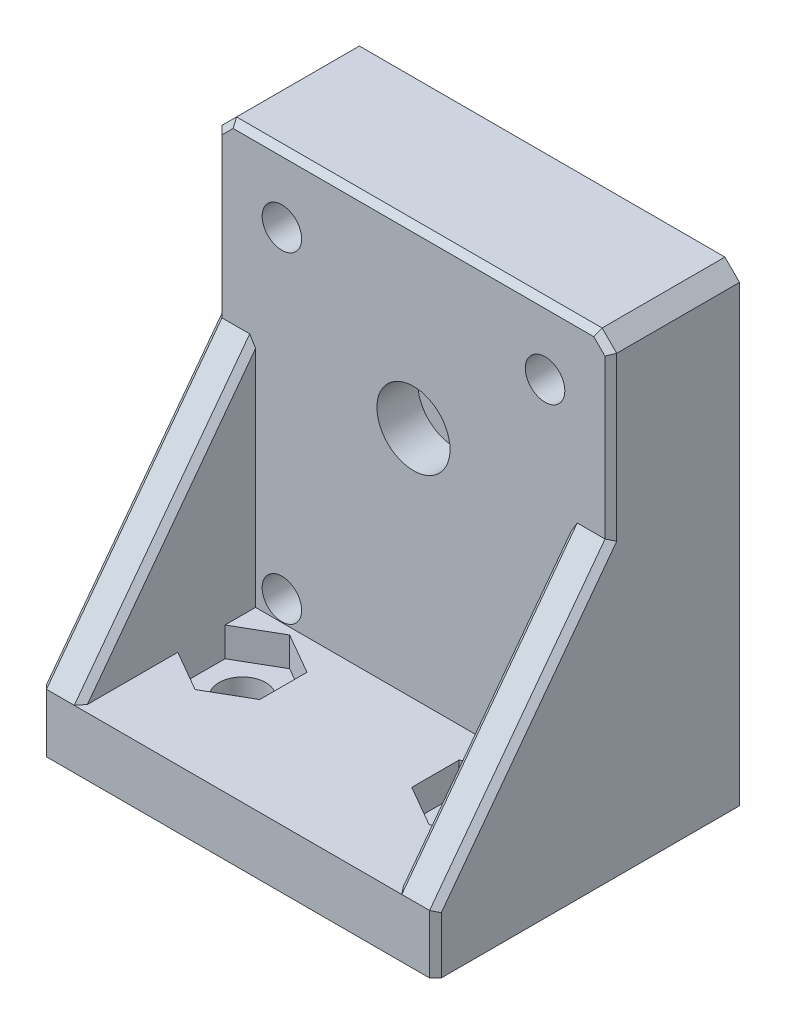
ISO-10303-21;
HEADER;
FILE_DESCRIPTION(('STEP AP214'),'2;1');
FILE_NAME('part.step','',(''),(''),'','','');
FILE_SCHEMA(('AUTOMOTIVE_DESIGN { 1 0 10303 214 1 1 1 1 }'));
ENDSEC;
DATA;
#1=APPLICATION_CONTEXT('core data for automotive mechanical design processes');
#2=APPLICATION_PROTOCOL_DEFINITION('international standard','automotive_design',2000,#1);
#3=PRODUCT_CONTEXT('',#1,'mechanical');
#4=PRODUCT('Part','Part','',(#3));
#5=PRODUCT_RELATED_PRODUCT_CATEGORY('part','',(#4));
#6=PRODUCT_DEFINITION_FORMATION('','',#4);
#7=PRODUCT_DEFINITION_CONTEXT('part definition',#1,'design');
#8=PRODUCT_DEFINITION('design','',#6,#7);
#9=PRODUCT_DEFINITION_SHAPE('','',#8);
#10=(LENGTH_UNIT() NAMED_UNIT(*) SI_UNIT(.MILLI.,.METRE.));
#11=(NAMED_UNIT(*) PLANE_ANGLE_UNIT() SI_UNIT($,.RADIAN.));
#12=(NAMED_UNIT(*) SI_UNIT($,.STERADIAN.) SOLID_ANGLE_UNIT());
#13=UNCERTAINTY_MEASURE_WITH_UNIT(LENGTH_MEASURE(1.E-05),#10,'distance_accuracy_value','');
#14=(GEOMETRIC_REPRESENTATION_CONTEXT(3) GLOBAL_UNCERTAINTY_ASSIGNED_CONTEXT((#13)) GLOBAL_UNIT_ASSIGNED_CONTEXT((#10,
#11,#12)) REPRESENTATION_CONTEXT('',''));
#15=CARTESIAN_POINT('',(0.,0.,0.));
#16=DIRECTION('',(0.,0.,1.));
#17=DIRECTION('',(1.,0.,0.));
#18=AXIS2_PLACEMENT_3D('',#15,#16,#17);
#19=CARTESIAN_POINT('',(0.,0.,-4.));
#20=DIRECTION('',(0.,0.,1.));
#21=DIRECTION('',(1.,0.,0.));
#22=AXIS2_PLACEMENT_3D('',#19,#20,#21);
#23=CYLINDRICAL_SURFACE('',#22,2.5);
#24=CARTESIAN_POINT('',(0.,0.,0.));
#25=DIRECTION('',(0.,0.,1.));
#26=DIRECTION('',(1.,0.,0.));
#27=AXIS2_PLACEMENT_3D('',#24,#25,#26);
#28=CIRCLE('',#27,2.5);
#29=CARTESIAN_POINT('',(2.5,0.,0.));
#30=VERTEX_POINT('',#29);
#31=EDGE_CURVE('E504',#30,#30,#28,.T.);
#32=ORIENTED_EDGE('',*,*,#31,.T.);
#33=EDGE_LOOP('',(#32));
#34=FACE_BOUND('',#33,.T.);
#35=CARTESIAN_POINT('',(0.,0.,-2.8));
#36=DIRECTION('',(0.,0.,-1.));
#37=DIRECTION('',(-1.,0.,0.));
#38=AXIS2_PLACEMENT_3D('',#35,#36,#37);
#39=CIRCLE('',#38,2.5);
#40=CARTESIAN_POINT('',(-2.5,0.,-2.8));
#41=VERTEX_POINT('',#40);
#42=EDGE_CURVE('E12',#41,#41,#39,.F.);
#43=ORIENTED_EDGE('',*,*,#42,.F.);
#44=EDGE_LOOP('',(#43));
#45=FACE_BOUND('',#44,.T.);
#46=ADVANCED_FACE('F36',(#34,#45),#23,.F.);
#47=CARTESIAN_POINT('',(-8.,12.,3.7));
#48=DIRECTION('',(0.,-1.,0.));
#49=DIRECTION('',(0.,0.,-1.));
#50=AXIS2_PLACEMENT_3D('',#47,#48,#49);
#51=CYLINDRICAL_SURFACE('',#50,1.6);
#52=CARTESIAN_POINT('',(-8.,-20.,3.7));
#53=DIRECTION('',(0.,-1.,0.));
#54=DIRECTION('',(0.,0.,-1.));
#55=AXIS2_PLACEMENT_3D('',#52,#53,#54);
#56=CIRCLE('',#55,1.6);
#57=CARTESIAN_POINT('',(-8.,-20.,2.1));
#58=VERTEX_POINT('',#57);
#59=EDGE_CURVE('E472',#58,#58,#56,.T.);
#60=ORIENTED_EDGE('',*,*,#59,.T.);
#61=EDGE_LOOP('',(#60));
#62=FACE_BOUND('',#61,.T.);
#63=CARTESIAN_POINT('',(-8.,-18.,3.7));
#64=DIRECTION('',(0.,1.,0.));
#65=DIRECTION('',(0.,0.,1.));
#66=AXIS2_PLACEMENT_3D('',#63,#64,#65);
#67=CIRCLE('',#66,1.6);
#68=CARTESIAN_POINT('',(-8.,-18.,5.3));
#69=VERTEX_POINT('',#68);
#70=EDGE_CURVE('E457',#69,#69,#67,.F.);
#71=ORIENTED_EDGE('',*,*,#70,.F.);
#72=EDGE_LOOP('',(#71));
#73=FACE_BOUND('',#72,.T.);
#74=ADVANCED_FACE('F747',(#62,#73),#51,.F.);
#75=CARTESIAN_POINT('',(13.5,-16.,12.));
#76=DIRECTION('',(0.,1.,0.));
#77=DIRECTION('',(0.,0.,1.));
#78=AXIS2_PLACEMENT_3D('',#75,#76,#77);
#79=PLANE('',#78);
#80=DIRECTION('',(-0.866025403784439,0.,-0.5));
#81=VECTOR('',#80,1.);
#82=CARTESIAN_POINT('',(8.,-16.,0.466838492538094));
#83=LINE('',#82,#81);
#84=CARTESIAN_POINT('',(10.8,-16.,2.08341924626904));
#85=VERTEX_POINT('',#84);
#86=CARTESIAN_POINT('',(8.,-16.,0.466838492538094));
#87=VERTEX_POINT('',#86);
#88=EDGE_CURVE('E404',#85,#87,#83,.T.);
#89=ORIENTED_EDGE('',*,*,#88,.F.);
#90=DIRECTION('',(0.,0.,-1.));
#91=VECTOR('',#90,1.);
#92=CARTESIAN_POINT('',(10.8,-16.,12.));
#93=LINE('',#92,#91);
#94=CARTESIAN_POINT('',(10.8,-16.,0.));
#95=VERTEX_POINT('',#94);
#96=EDGE_CURVE('E484',#85,#95,#93,.T.);
#97=ORIENTED_EDGE('',*,*,#96,.T.);
#98=DIRECTION('',(1.,0.,0.));
#99=VECTOR('',#98,1.);
#100=CARTESIAN_POINT('',(13.5,-16.,0.));
#101=LINE('',#100,#99);
#102=CARTESIAN_POINT('',(-10.8,-16.,0.));
#103=VERTEX_POINT('',#102);
#104=EDGE_CURVE('E494',#103,#95,#101,.T.);
#105=ORIENTED_EDGE('',*,*,#104,.F.);
#106=DIRECTION('',(0.,0.,-1.));
#107=VECTOR('',#106,1.);
#108=CARTESIAN_POINT('',(-10.8,-16.,12.));
#109=LINE('',#108,#107);
#110=CARTESIAN_POINT('',(-10.8,-16.,2.08341924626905));
#111=VERTEX_POINT('',#110);
#112=EDGE_CURVE('E475',#111,#103,#109,.T.);
#113=ORIENTED_EDGE('',*,*,#112,.F.);
#114=DIRECTION('',(-0.866025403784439,0.,0.5));
#115=VECTOR('',#114,1.);
#116=CARTESIAN_POINT('',(-8.,-16.,0.466838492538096));
#117=LINE('',#116,#115);
#118=CARTESIAN_POINT('',(-8.,-16.,0.466838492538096));
#119=VERTEX_POINT('',#118);
#120=EDGE_CURVE('E451',#119,#111,#117,.T.);
#121=ORIENTED_EDGE('',*,*,#120,.F.);
#122=DIRECTION('',(-0.866025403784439,0.,-0.5));
#123=VECTOR('',#122,1.);
#124=CARTESIAN_POINT('',(-5.2,-16.,2.08341924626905));
#125=LINE('',#124,#123);
#126=CARTESIAN_POINT('',(-5.2,-16.,2.08341924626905));
#127=VERTEX_POINT('',#126);
#128=EDGE_CURVE('E448',#127,#119,#125,.T.);
#129=ORIENTED_EDGE('',*,*,#128,.F.);
#130=DIRECTION('',(0.,0.,-1.));
#131=VECTOR('',#130,1.);
#132=CARTESIAN_POINT('',(-5.2,-16.,5.31658075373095));
#133=LINE('',#132,#131);
#134=CARTESIAN_POINT('',(-5.2,-16.,5.31658075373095));
#135=VERTEX_POINT('',#134);
#136=EDGE_CURVE('E445',#135,#127,#133,.T.);
#137=ORIENTED_EDGE('',*,*,#136,.F.);
#138=DIRECTION('',(0.866025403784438,0.,-0.5));
#139=VECTOR('',#138,1.);
#140=CARTESIAN_POINT('',(-8.,-16.,6.9331615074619));
#141=LINE('',#140,#139);
#142=CARTESIAN_POINT('',(-8.,-16.,6.9331615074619));
#143=VERTEX_POINT('',#142);
#144=EDGE_CURVE('E442',#143,#135,#141,.T.);
#145=ORIENTED_EDGE('',*,*,#144,.F.);
#146=DIRECTION('',(0.866025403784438,0.,0.5));
#147=VECTOR('',#146,1.);
#148=CARTESIAN_POINT('',(-10.8,-16.,5.31658075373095));
#149=LINE('',#148,#147);
#150=CARTESIAN_POINT('',(-10.8,-16.,5.31658075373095));
#151=VERTEX_POINT('',#150);
#152=EDGE_CURVE('E426',#151,#143,#149,.T.);
#153=ORIENTED_EDGE('',*,*,#152,.F.);
#154=CARTESIAN_POINT('',(-10.8,-16.,11.5));
#155=VERTEX_POINT('',#154);
#156=EDGE_CURVE('E476',#155,#151,#109,.T.);
#157=ORIENTED_EDGE('',*,*,#156,.F.);
#158=DIRECTION('',(0.624695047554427,0.,-0.780868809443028));
#159=VECTOR('',#158,1.);
#160=CARTESIAN_POINT('',(-5.0341463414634,-16.,4.29268292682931));
#161=LINE('',#160,#159);
#162=CARTESIAN_POINT('',(-11.2,-16.,12.));
#163=VERTEX_POINT('',#162);
#164=EDGE_CURVE('E601',#155,#163,#161,.F.);
#165=ORIENTED_EDGE('',*,*,#164,.T.);
#166=DIRECTION('',(1.,0.,0.));
#167=VECTOR('',#166,1.);
#168=CARTESIAN_POINT('',(10.8,-16.,12.));
#169=LINE('',#168,#167);
#170=CARTESIAN_POINT('',(11.2,-16.,12.));
#171=VERTEX_POINT('',#170);
#172=EDGE_CURVE('E491',#163,#171,#169,.T.);
#173=ORIENTED_EDGE('',*,*,#172,.T.);
#174=DIRECTION('',(-0.62469504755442,0.,-0.780868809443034));
#175=VECTOR('',#174,1.);
#176=CARTESIAN_POINT('',(5.34634146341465,-16.,4.68292682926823));
#177=LINE('',#176,#175);
#178=CARTESIAN_POINT('',(10.8,-16.,11.5));
#179=VERTEX_POINT('',#178);
#180=EDGE_CURVE('E606',#171,#179,#177,.T.);
#181=ORIENTED_EDGE('',*,*,#180,.T.);
#182=CARTESIAN_POINT('',(10.8,-16.,5.31658075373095));
#183=VERTEX_POINT('',#182);
#184=EDGE_CURVE('E485',#179,#183,#93,.T.);
#185=ORIENTED_EDGE('',*,*,#184,.T.);
#186=DIRECTION('',(0.866025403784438,0.,-0.500000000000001));
#187=VECTOR('',#186,1.);
#188=CARTESIAN_POINT('',(10.8,-16.,5.31658075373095));
#189=LINE('',#188,#187);
#190=CARTESIAN_POINT('',(8.,-16.,6.9331615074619));
#191=VERTEX_POINT('',#190);
#192=EDGE_CURVE('E401',#191,#183,#189,.T.);
#193=ORIENTED_EDGE('',*,*,#192,.F.);
#194=DIRECTION('',(0.866025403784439,0.,0.5));
#195=VECTOR('',#194,1.);
#196=CARTESIAN_POINT('',(8.,-16.,6.9331615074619));
#197=LINE('',#196,#195);
#198=CARTESIAN_POINT('',(5.2,-16.,5.31658075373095));
#199=VERTEX_POINT('',#198);
#200=EDGE_CURVE('E398',#199,#191,#197,.T.);
#201=ORIENTED_EDGE('',*,*,#200,.F.);
#202=DIRECTION('',(0.,0.,1.));
#203=VECTOR('',#202,1.);
#204=CARTESIAN_POINT('',(5.2,-16.,5.31658075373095));
#205=LINE('',#204,#203);
#206=CARTESIAN_POINT('',(5.2,-16.,2.08341924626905));
#207=VERTEX_POINT('',#206);
#208=EDGE_CURVE('E369',#207,#199,#205,.T.);
#209=ORIENTED_EDGE('',*,*,#208,.F.);
#210=DIRECTION('',(-0.866025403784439,0.,0.5));
#211=VECTOR('',#210,1.);
#212=CARTESIAN_POINT('',(5.2,-16.,2.08341924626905));
#213=LINE('',#212,#211);
#214=EDGE_CURVE('E380',#87,#207,#213,.T.);
#215=ORIENTED_EDGE('',*,*,#214,.F.);
#216=EDGE_LOOP('',(#89,#97,#105,#113,#121,#129,#137,#145,#153,#157,#165,#173,#181,#185,#193,
#201,#209,#215));
#217=FACE_BOUND('',#216,.T.);
#218=ADVANCED_FACE('F753',(#217),#79,.T.);
#219=CARTESIAN_POINT('',(0.,0.,0.));
#220=DIRECTION('',(0.,0.,-1.));
#221=DIRECTION('',(-1.,0.,0.));
#222=AXIS2_PLACEMENT_3D('',#219,#220,#221);
#223=PLANE('',#222);
#224=CARTESIAN_POINT('',(9.,-14.6,0.));
#225=DIRECTION('',(0.,0.,1.));
#226=DIRECTION('',(1.,0.,0.));
#227=AXIS2_PLACEMENT_3D('',#224,#225,#226);
#228=CIRCLE('',#227,1.35);
#229=CARTESIAN_POINT('',(10.35,-14.6,0.));
#230=VERTEX_POINT('',#229);
#231=EDGE_CURVE('E1225',#230,#230,#228,.T.);
#232=ORIENTED_EDGE('',*,*,#231,.F.);
#233=EDGE_LOOP('',(#232));
#234=FACE_BOUND('',#233,.T.);
#235=CARTESIAN_POINT('',(-9.,-14.6,0.));
#236=DIRECTION('',(0.,0.,1.));
#237=DIRECTION('',(1.,0.,0.));
#238=AXIS2_PLACEMENT_3D('',#235,#236,#237);
#239=CIRCLE('',#238,1.35);
#240=CARTESIAN_POINT('',(-7.65,-14.6,0.));
#241=VERTEX_POINT('',#240);
#242=EDGE_CURVE('E1229',#241,#241,#239,.T.);
#243=ORIENTED_EDGE('',*,*,#242,.F.);
#244=EDGE_LOOP('',(#243));
#245=FACE_BOUND('',#244,.T.);
#246=CARTESIAN_POINT('',(-9.,7.4,0.));
#247=DIRECTION('',(0.,0.,1.));
#248=DIRECTION('',(1.,0.,0.));
#249=AXIS2_PLACEMENT_3D('',#246,#247,#248);
#250=CIRCLE('',#249,1.35);
#251=CARTESIAN_POINT('',(-7.65,7.4,0.));
#252=VERTEX_POINT('',#251);
#253=EDGE_CURVE('E1236',#252,#252,#250,.T.);
#254=ORIENTED_EDGE('',*,*,#253,.F.);
#255=EDGE_LOOP('',(#254));
#256=FACE_BOUND('',#255,.T.);
#257=CARTESIAN_POINT('',(9.,7.4,0.));
#258=DIRECTION('',(0.,0.,1.));
#259=DIRECTION('',(1.,0.,0.));
#260=AXIS2_PLACEMENT_3D('',#257,#258,#259);
#261=CIRCLE('',#260,1.35);
#262=CARTESIAN_POINT('',(10.35,7.4,0.));
#263=VERTEX_POINT('',#262);
#264=EDGE_CURVE('E613',#263,#263,#261,.T.);
#265=ORIENTED_EDGE('',*,*,#264,.F.);
#266=EDGE_LOOP('',(#265));
#267=FACE_BOUND('',#266,.T.);
#268=ORIENTED_EDGE('',*,*,#31,.F.);
#269=EDGE_LOOP('',(#268));
#270=FACE_BOUND('',#269,.T.);
#271=DIRECTION('',(1.,0.,0.));
#272=VECTOR('',#271,1.);
#273=CARTESIAN_POINT('',(10.8,0.,0.));
#274=LINE('',#273,#272);
#275=CARTESIAN_POINT('',(11.2,0.,0.));
#276=VERTEX_POINT('',#275);
#277=CARTESIAN_POINT('',(13.1,0.,0.));
#278=VERTEX_POINT('',#277);
#279=EDGE_CURVE('E490',#276,#278,#274,.T.);
#280=ORIENTED_EDGE('',*,*,#279,.T.);
#281=DIRECTION('',(0.,1.,0.));
#282=VECTOR('',#281,1.);
#283=CARTESIAN_POINT('',(13.1,11.,0.));
#284=LINE('',#283,#282);
#285=CARTESIAN_POINT('',(13.1,10.8343145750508,0.));
#286=VERTEX_POINT('',#285);
#287=EDGE_CURVE('E595',#278,#286,#284,.T.);
#288=ORIENTED_EDGE('',*,*,#287,.T.);
#289=DIRECTION('',(-0.707106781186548,0.707106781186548,0.));
#290=VECTOR('',#289,1.);
#291=CARTESIAN_POINT('',(12.2171572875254,11.7171572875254,0.));
#292=LINE('',#291,#290);
#293=CARTESIAN_POINT('',(12.3343145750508,11.6,0.));
#294=VERTEX_POINT('',#293);
#295=EDGE_CURVE('E593',#286,#294,#292,.T.);
#296=ORIENTED_EDGE('',*,*,#295,.T.);
#297=DIRECTION('',(-1.,0.,0.));
#298=VECTOR('',#297,1.);
#299=CARTESIAN_POINT('',(-12.5,11.6,0.));
#300=LINE('',#299,#298);
#301=CARTESIAN_POINT('',(-12.3343145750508,11.6,0.));
#302=VERTEX_POINT('',#301);
#303=EDGE_CURVE('E591',#294,#302,#300,.T.);
#304=ORIENTED_EDGE('',*,*,#303,.T.);
#305=DIRECTION('',(-0.707106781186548,-0.707106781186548,0.));
#306=VECTOR('',#305,1.);
#307=CARTESIAN_POINT('',(-13.2171572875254,10.7171572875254,0.));
#308=LINE('',#307,#306);
#309=CARTESIAN_POINT('',(-13.1,10.8343145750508,0.));
#310=VERTEX_POINT('',#309);
#311=EDGE_CURVE('E589',#302,#310,#308,.T.);
#312=ORIENTED_EDGE('',*,*,#311,.T.);
#313=DIRECTION('',(0.,-1.,0.));
#314=VECTOR('',#313,1.);
#315=CARTESIAN_POINT('',(-13.1,0.,0.));
#316=LINE('',#315,#314);
#317=CARTESIAN_POINT('',(-13.1,0.,0.));
#318=VERTEX_POINT('',#317);
#319=EDGE_CURVE('E587',#310,#318,#316,.T.);
#320=ORIENTED_EDGE('',*,*,#319,.T.);
#321=DIRECTION('',(-1.,0.,0.));
#322=VECTOR('',#321,1.);
#323=CARTESIAN_POINT('',(-10.8,0.,0.));
#324=LINE('',#323,#322);
#325=CARTESIAN_POINT('',(-11.2,0.,0.));
#326=VERTEX_POINT('',#325);
#327=EDGE_CURVE('E481',#326,#318,#324,.T.);
#328=ORIENTED_EDGE('',*,*,#327,.F.);
#329=DIRECTION('',(-0.514495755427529,0.857492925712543,0.));
#330=VECTOR('',#329,1.);
#331=CARTESIAN_POINT('',(-8.23529411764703,-4.94117647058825,0.));
#332=LINE('',#331,#330);
#333=CARTESIAN_POINT('',(-10.8,-0.666666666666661,0.));
#334=VERTEX_POINT('',#333);
#335=EDGE_CURVE('E604',#326,#334,#332,.F.);
#336=ORIENTED_EDGE('',*,*,#335,.T.);
#337=DIRECTION('',(0.,1.,0.));
#338=VECTOR('',#337,1.);
#339=CARTESIAN_POINT('',(-10.8,-16.,0.));
#340=LINE('',#339,#338);
#341=EDGE_CURVE('E478',#103,#334,#340,.T.);
#342=ORIENTED_EDGE('',*,*,#341,.F.);
#343=ORIENTED_EDGE('',*,*,#104,.T.);
#344=DIRECTION('',(0.,1.,0.));
#345=VECTOR('',#344,1.);
#346=CARTESIAN_POINT('',(10.8,-16.,0.));
#347=LINE('',#346,#345);
#348=CARTESIAN_POINT('',(10.8,-0.666666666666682,0.));
#349=VERTEX_POINT('',#348);
#350=EDGE_CURVE('E487',#95,#349,#347,.T.);
#351=ORIENTED_EDGE('',*,*,#350,.T.);
#352=DIRECTION('',(0.514495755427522,0.857492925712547,0.));
#353=VECTOR('',#352,1.);
#354=CARTESIAN_POINT('',(8.23529411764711,-4.94117647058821,0.));
#355=LINE('',#354,#353);
#356=EDGE_CURVE('E44',#349,#276,#355,.T.);
#357=ORIENTED_EDGE('',*,*,#356,.T.);
#358=EDGE_LOOP('',(#280,#288,#296,#304,#312,#320,#328,#336,#342,#343,#351,#357));
#359=FACE_BOUND('',#358,.T.);
#360=ADVANCED_FACE('F672',(#234,#245,#256,#267,#270,#359),#223,.F.);
#361=CARTESIAN_POINT('',(13.5,-20.,-4.));
#362=DIRECTION('',(1.,0.,0.));
#363=DIRECTION('',(0.,0.,-1.));
#364=AXIS2_PLACEMENT_3D('',#361,#362,#363);
#365=PLANE('',#364);
#366=DIRECTION('',(0.,-0.8,0.6));
#367=VECTOR('',#366,1.);
#368=CARTESIAN_POINT('',(13.5,-11.12,7.84000000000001));
#369=LINE('',#368,#367);
#370=CARTESIAN_POINT('',(13.5,-0.133333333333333,-0.399999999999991));
#371=VERTEX_POINT('',#370);
#372=CARTESIAN_POINT('',(13.5,-16.1333333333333,11.6));
#373=VERTEX_POINT('',#372);
#374=EDGE_CURVE('E572',#371,#373,#369,.T.);
#375=ORIENTED_EDGE('',*,*,#374,.T.);
#376=DIRECTION('',(0.,-1.,0.));
#377=VECTOR('',#376,1.);
#378=CARTESIAN_POINT('',(13.5,-20.,11.6));
#379=LINE('',#378,#377);
#380=CARTESIAN_POINT('',(13.5,-20.,11.6));
#381=VERTEX_POINT('',#380);
#382=EDGE_CURVE('E574',#373,#381,#379,.T.);
#383=ORIENTED_EDGE('',*,*,#382,.T.);
#384=DIRECTION('',(0.,0.,1.));
#385=VECTOR('',#384,1.);
#386=CARTESIAN_POINT('',(13.5,-20.,-4.));
#387=LINE('',#386,#385);
#388=CARTESIAN_POINT('',(13.5,-20.,-8.8));
#389=VERTEX_POINT('',#388);
#390=EDGE_CURVE('E521',#389,#381,#387,.T.);
#391=ORIENTED_EDGE('',*,*,#390,.F.);
#392=DIRECTION('',(0.,1.,0.));
#393=VECTOR('',#392,1.);
#394=CARTESIAN_POINT('',(13.5,-20.,-8.8));
#395=LINE('',#394,#393);
#396=CARTESIAN_POINT('',(13.5,11.,-8.8));
#397=VERTEX_POINT('',#396);
#398=EDGE_CURVE('E534',#389,#397,#395,.T.);
#399=ORIENTED_EDGE('',*,*,#398,.T.);
#400=DIRECTION('',(0.,0.,1.));
#401=VECTOR('',#400,1.);
#402=CARTESIAN_POINT('',(13.5,11.,-4.));
#403=LINE('',#402,#401);
#404=CARTESIAN_POINT('',(13.5,11.,-0.399999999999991));
#405=VERTEX_POINT('',#404);
#406=EDGE_CURVE('E517',#397,#405,#403,.T.);
#407=ORIENTED_EDGE('',*,*,#406,.T.);
#408=DIRECTION('',(0.,-1.,0.));
#409=VECTOR('',#408,1.);
#410=CARTESIAN_POINT('',(13.5,0.,-0.399999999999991));
#411=LINE('',#410,#409);
#412=EDGE_CURVE('E570',#405,#371,#411,.T.);
#413=ORIENTED_EDGE('',*,*,#412,.T.);
#414=EDGE_LOOP('',(#375,#383,#391,#399,#407,#413));
#415=FACE_BOUND('',#414,.T.);
#416=ADVANCED_FACE('F655',(#415),#365,.T.);
#417=CARTESIAN_POINT('',(-13.5,-20.,-4.));
#418=DIRECTION('',(0.,-1.,0.));
#419=DIRECTION('',(0.,0.,-1.));
#420=AXIS2_PLACEMENT_3D('',#417,#418,#419);
#421=PLANE('',#420);
#422=CARTESIAN_POINT('',(8.,-20.,3.7));
#423=DIRECTION('',(0.,-1.,0.));
#424=DIRECTION('',(0.,0.,1.));
#425=AXIS2_PLACEMENT_3D('',#422,#423,#424);
#426=CIRCLE('',#425,1.6);
#427=CARTESIAN_POINT('',(8.,-20.,5.3));
#428=VERTEX_POINT('',#427);
#429=EDGE_CURVE('E469',#428,#428,#426,.T.);
#430=ORIENTED_EDGE('',*,*,#429,.F.);
#431=EDGE_LOOP('',(#430));
#432=FACE_BOUND('',#431,.T.);
#433=ORIENTED_EDGE('',*,*,#59,.F.);
#434=EDGE_LOOP('',(#433));
#435=FACE_BOUND('',#434,.T.);
#436=ORIENTED_EDGE('',*,*,#390,.T.);
#437=DIRECTION('',(0.707106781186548,0.,-0.707106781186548));
#438=VECTOR('',#437,1.);
#439=CARTESIAN_POINT('',(7.8,-20.,17.3));
#440=LINE('',#439,#438);
#441=CARTESIAN_POINT('',(13.1,-20.,12.));
#442=VERTEX_POINT('',#441);
#443=EDGE_CURVE('E579',#381,#442,#440,.F.);
#444=ORIENTED_EDGE('',*,*,#443,.T.);
#445=DIRECTION('',(-1.,0.,0.));
#446=VECTOR('',#445,1.);
#447=CARTESIAN_POINT('',(13.5,-20.,12.));
#448=LINE('',#447,#446);
#449=CARTESIAN_POINT('',(-13.1,-20.,12.));
#450=VERTEX_POINT('',#449);
#451=EDGE_CURVE('E498',#442,#450,#448,.T.);
#452=ORIENTED_EDGE('',*,*,#451,.T.);
#453=DIRECTION('',(0.707106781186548,0.,0.707106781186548));
#454=VECTOR('',#453,1.);
#455=CARTESIAN_POINT('',(-21.3,-20.,3.8));
#456=LINE('',#455,#454);
#457=CARTESIAN_POINT('',(-13.5,-20.,11.6));
#458=VERTEX_POINT('',#457);
#459=EDGE_CURVE('E577',#450,#458,#456,.F.);
#460=ORIENTED_EDGE('',*,*,#459,.T.);
#461=DIRECTION('',(0.,0.,1.));
#462=VECTOR('',#461,1.);
#463=CARTESIAN_POINT('',(-13.5,-20.,-4.));
#464=LINE('',#463,#462);
#465=CARTESIAN_POINT('',(-13.5,-20.,-8.8));
#466=VERTEX_POINT('',#465);
#467=EDGE_CURVE('E512',#466,#458,#464,.T.);
#468=ORIENTED_EDGE('',*,*,#467,.F.);
#469=DIRECTION('',(1.,0.,0.));
#470=VECTOR('',#469,1.);
#471=CARTESIAN_POINT('',(-13.5,-20.,-8.8));
#472=LINE('',#471,#470);
#473=EDGE_CURVE('E539',#466,#389,#472,.T.);
#474=ORIENTED_EDGE('',*,*,#473,.T.);
#475=EDGE_LOOP('',(#436,#444,#452,#460,#468,#474));
#476=FACE_BOUND('',#475,.T.);
#477=ADVANCED_FACE('F648',(#432,#435,#476),#421,.T.);
#478=CARTESIAN_POINT('',(-13.5,-20.,-4.));
#479=DIRECTION('',(-1.,0.,0.));
#480=DIRECTION('',(0.,0.,1.));
#481=AXIS2_PLACEMENT_3D('',#478,#479,#480);
#482=PLANE('',#481);
#483=ORIENTED_EDGE('',*,*,#467,.T.);
#484=DIRECTION('',(0.,1.,0.));
#485=VECTOR('',#484,1.);
#486=CARTESIAN_POINT('',(-13.5,-20.,11.6));
#487=LINE('',#486,#485);
#488=CARTESIAN_POINT('',(-13.5,-16.1333333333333,11.6));
#489=VERTEX_POINT('',#488);
#490=EDGE_CURVE('E585',#458,#489,#487,.T.);
#491=ORIENTED_EDGE('',*,*,#490,.T.);
#492=DIRECTION('',(0.,0.8,-0.6));
#493=VECTOR('',#492,1.);
#494=CARTESIAN_POINT('',(-13.5,-0.239999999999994,-0.319999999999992));
#495=LINE('',#494,#493);
#496=CARTESIAN_POINT('',(-13.5,-0.133333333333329,-0.399999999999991));
#497=VERTEX_POINT('',#496);
#498=EDGE_CURVE('E583',#489,#497,#495,.T.);
#499=ORIENTED_EDGE('',*,*,#498,.T.);
#500=DIRECTION('',(0.,1.,0.));
#501=VECTOR('',#500,1.);
#502=CARTESIAN_POINT('',(-13.5,11.,-0.399999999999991));
#503=LINE('',#502,#501);
#504=CARTESIAN_POINT('',(-13.5,11.,-0.399999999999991));
#505=VERTEX_POINT('',#504);
#506=EDGE_CURVE('E581',#497,#505,#503,.T.);
#507=ORIENTED_EDGE('',*,*,#506,.T.);
#508=DIRECTION('',(0.,0.,-1.));
#509=VECTOR('',#508,1.);
#510=CARTESIAN_POINT('',(-13.5,11.,-4.));
#511=LINE('',#510,#509);
#512=CARTESIAN_POINT('',(-13.5,11.,-8.8));
#513=VERTEX_POINT('',#512);
#514=EDGE_CURVE('E526',#505,#513,#511,.T.);
#515=ORIENTED_EDGE('',*,*,#514,.T.);
#516=DIRECTION('',(0.,-1.,0.));
#517=VECTOR('',#516,1.);
#518=CARTESIAN_POINT('',(-13.5,-20.,-8.8));
#519=LINE('',#518,#517);
#520=CARTESIAN_POINT('',(-13.5,4.,-8.8));
#521=VERTEX_POINT('',#520);
#522=EDGE_CURVE('E536',#513,#521,#519,.T.);
#523=ORIENTED_EDGE('',*,*,#522,.T.);
#524=DIRECTION('',(0.,0.,-1.));
#525=VECTOR('',#524,1.);
#526=CARTESIAN_POINT('',(-13.5,4.,-5.8));
#527=LINE('',#526,#525);
#528=CARTESIAN_POINT('',(-13.5,4.,-5.8));
#529=VERTEX_POINT('',#528);
#530=EDGE_CURVE('E336',#529,#521,#527,.T.);
#531=ORIENTED_EDGE('',*,*,#530,.F.);
#532=DIRECTION('',(0.,1.,0.));
#533=VECTOR('',#532,1.);
#534=CARTESIAN_POINT('',(-13.5,4.,-5.8));
#535=LINE('',#534,#533);
#536=CARTESIAN_POINT('',(-13.5,-4.,-5.8));
#537=VERTEX_POINT('',#536);
#538=EDGE_CURVE('E333',#537,#529,#535,.T.);
#539=ORIENTED_EDGE('',*,*,#538,.F.);
#540=DIRECTION('',(0.,0.,1.));
#541=VECTOR('',#540,1.);
#542=CARTESIAN_POINT('',(-13.5,-4.,-5.8));
#543=LINE('',#542,#541);
#544=CARTESIAN_POINT('',(-13.5,-4.,-8.8));
#545=VERTEX_POINT('',#544);
#546=EDGE_CURVE('E306',#545,#537,#543,.T.);
#547=ORIENTED_EDGE('',*,*,#546,.F.);
#548=EDGE_CURVE('E533',#545,#466,#519,.T.);
#549=ORIENTED_EDGE('',*,*,#548,.T.);
#550=EDGE_LOOP('',(#483,#491,#499,#507,#515,#523,#531,#539,#547,#549));
#551=FACE_BOUND('',#550,.T.);
#552=ADVANCED_FACE('F696',(#551),#482,.T.);
#553=CARTESIAN_POINT('',(-13.5,12.,-4.));
#554=DIRECTION('',(0.,1.,0.));
#555=DIRECTION('',(0.,0.,1.));
#556=AXIS2_PLACEMENT_3D('',#553,#554,#555);
#557=PLANE('',#556);
#558=DIRECTION('',(0.,0.,1.));
#559=VECTOR('',#558,1.);
#560=CARTESIAN_POINT('',(-12.5,12.,-4.));
#561=LINE('',#560,#559);
#562=CARTESIAN_POINT('',(-12.5,12.,-8.8));
#563=VERTEX_POINT('',#562);
#564=CARTESIAN_POINT('',(-12.5,12.,-0.399999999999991));
#565=VERTEX_POINT('',#564);
#566=EDGE_CURVE('E520',#563,#565,#561,.T.);
#567=ORIENTED_EDGE('',*,*,#566,.T.);
#568=DIRECTION('',(1.,0.,0.));
#569=VECTOR('',#568,1.);
#570=CARTESIAN_POINT('',(12.5,12.,-0.399999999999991));
#571=LINE('',#570,#569);
#572=CARTESIAN_POINT('',(12.5,12.,-0.399999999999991));
#573=VERTEX_POINT('',#572);
#574=EDGE_CURVE('E58',#565,#573,#571,.T.);
#575=ORIENTED_EDGE('',*,*,#574,.T.);
#576=DIRECTION('',(0.,0.,-1.));
#577=VECTOR('',#576,1.);
#578=CARTESIAN_POINT('',(12.5,12.,-4.));
#579=LINE('',#578,#577);
#580=CARTESIAN_POINT('',(12.5,12.,-8.8));
#581=VERTEX_POINT('',#580);
#582=EDGE_CURVE('E523',#573,#581,#579,.T.);
#583=ORIENTED_EDGE('',*,*,#582,.T.);
#584=DIRECTION('',(-1.,0.,0.));
#585=VECTOR('',#584,1.);
#586=CARTESIAN_POINT('',(-13.5,12.,-8.8));
#587=LINE('',#586,#585);
#588=EDGE_CURVE('E530',#581,#563,#587,.T.);
#589=ORIENTED_EDGE('',*,*,#588,.T.);
#590=EDGE_LOOP('',(#567,#575,#583,#589));
#591=FACE_BOUND('',#590,.T.);
#592=ADVANCED_FACE('F705',(#591),#557,.T.);
#593=CARTESIAN_POINT('',(0.,0.,-8.8));
#594=DIRECTION('',(0.,0.,-1.));
#595=DIRECTION('',(-1.,0.,0.));
#596=AXIS2_PLACEMENT_3D('',#593,#594,#595);
#597=PLANE('',#596);
#598=CARTESIAN_POINT('',(9.,-14.6,-8.8));
#599=DIRECTION('',(0.,0.,-1.));
#600=DIRECTION('',(-1.,0.,0.));
#601=AXIS2_PLACEMENT_3D('',#598,#599,#600);
#602=CIRCLE('',#601,1.35);
#603=CARTESIAN_POINT('',(7.65,-14.6,-8.8));
#604=VERTEX_POINT('',#603);
#605=EDGE_CURVE('E1222',#604,#604,#602,.F.);
#606=ORIENTED_EDGE('',*,*,#605,.T.);
#607=EDGE_LOOP('',(#606));
#608=FACE_BOUND('',#607,.T.);
#609=CARTESIAN_POINT('',(-9.,-14.6,-8.8));
#610=DIRECTION('',(0.,0.,-1.));
#611=DIRECTION('',(-1.,0.,0.));
#612=AXIS2_PLACEMENT_3D('',#609,#610,#611);
#613=CIRCLE('',#612,1.35);
#614=CARTESIAN_POINT('',(-10.35,-14.6,-8.8));
#615=VERTEX_POINT('',#614);
#616=EDGE_CURVE('E1226',#615,#615,#613,.F.);
#617=ORIENTED_EDGE('',*,*,#616,.T.);
#618=EDGE_LOOP('',(#617));
#619=FACE_BOUND('',#618,.T.);
#620=CARTESIAN_POINT('',(-9.,7.4,-8.8));
#621=DIRECTION('',(0.,0.,-1.));
#622=DIRECTION('',(-1.,0.,0.));
#623=AXIS2_PLACEMENT_3D('',#620,#621,#622);
#624=CIRCLE('',#623,1.35);
#625=CARTESIAN_POINT('',(-10.35,7.4,-8.8));
#626=VERTEX_POINT('',#625);
#627=EDGE_CURVE('E1234',#626,#626,#624,.F.);
#628=ORIENTED_EDGE('',*,*,#627,.T.);
#629=EDGE_LOOP('',(#628));
#630=FACE_BOUND('',#629,.T.);
#631=CARTESIAN_POINT('',(9.,7.4,-8.8));
#632=DIRECTION('',(0.,0.,-1.));
#633=DIRECTION('',(-1.,0.,0.));
#634=AXIS2_PLACEMENT_3D('',#631,#632,#633);
#635=CIRCLE('',#634,1.35);
#636=CARTESIAN_POINT('',(7.65,7.4,-8.8));
#637=VERTEX_POINT('',#636);
#638=EDGE_CURVE('E1239',#637,#637,#635,.F.);
#639=ORIENTED_EDGE('',*,*,#638,.T.);
#640=EDGE_LOOP('',(#639));
#641=FACE_BOUND('',#640,.T.);
#642=DIRECTION('',(-1.,0.,0.));
#643=VECTOR('',#642,1.);
#644=CARTESIAN_POINT('',(3.54400374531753,-4.,-8.8));
#645=LINE('',#644,#643);
#646=CARTESIAN_POINT('',(-10.,-4.,-8.8));
#647=VERTEX_POINT('',#646);
#648=EDGE_CURVE('E338',#647,#545,#645,.T.);
#649=ORIENTED_EDGE('',*,*,#648,.F.);
#650=DIRECTION('',(-0.707106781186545,0.70710678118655,0.));
#651=VECTOR('',#650,1.);
#652=CARTESIAN_POINT('',(-7.00000000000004,-6.99999999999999,-8.8));
#653=LINE('',#652,#651);
#654=CARTESIAN_POINT('',(-8.,-6.00000000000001,-8.8));
#655=VERTEX_POINT('',#654);
#656=EDGE_CURVE('E547',#647,#655,#653,.F.);
#657=ORIENTED_EDGE('',*,*,#656,.T.);
#658=DIRECTION('',(0.,1.,0.));
#659=VECTOR('',#658,1.);
#660=CARTESIAN_POINT('',(-8.,-11.,-8.8));
#661=LINE('',#660,#659);
#662=CARTESIAN_POINT('',(-8.,-11.,-8.8));
#663=VERTEX_POINT('',#662);
#664=EDGE_CURVE('E320',#663,#655,#661,.T.);
#665=ORIENTED_EDGE('',*,*,#664,.F.);
#666=DIRECTION('',(-1.,0.,0.));
#667=VECTOR('',#666,1.);
#668=CARTESIAN_POINT('',(5.,-11.,-8.8));
#669=LINE('',#668,#667);
#670=CARTESIAN_POINT('',(5.,-11.,-8.8));
#671=VERTEX_POINT('',#670);
#672=EDGE_CURVE('E314',#671,#663,#669,.T.);
#673=ORIENTED_EDGE('',*,*,#672,.F.);
#674=DIRECTION('',(0.,-1.,0.));
#675=VECTOR('',#674,1.);
#676=CARTESIAN_POINT('',(5.,-11.,-8.8));
#677=LINE('',#676,#675);
#678=CARTESIAN_POINT('',(5.,5.,-8.8));
#679=VERTEX_POINT('',#678);
#680=EDGE_CURVE('E363',#679,#671,#677,.T.);
#681=ORIENTED_EDGE('',*,*,#680,.F.);
#682=DIRECTION('',(1.,0.,0.));
#683=VECTOR('',#682,1.);
#684=CARTESIAN_POINT('',(5.,5.,-8.8));
#685=LINE('',#684,#683);
#686=CARTESIAN_POINT('',(-5.,5.,-8.8));
#687=VERTEX_POINT('',#686);
#688=EDGE_CURVE('E360',#687,#679,#685,.T.);
#689=ORIENTED_EDGE('',*,*,#688,.F.);
#690=DIRECTION('',(0.,1.,0.));
#691=VECTOR('',#690,1.);
#692=CARTESIAN_POINT('',(-5.,-11.,-8.8));
#693=LINE('',#692,#691);
#694=CARTESIAN_POINT('',(-5.,4.,-8.8));
#695=VERTEX_POINT('',#694);
#696=EDGE_CURVE('E330',#695,#687,#693,.T.);
#697=ORIENTED_EDGE('',*,*,#696,.F.);
#698=DIRECTION('',(-1.,0.,0.));
#699=VECTOR('',#698,1.);
#700=CARTESIAN_POINT('',(3.54400374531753,4.,-8.8));
#701=LINE('',#700,#699);
#702=EDGE_CURVE('E328',#695,#521,#701,.T.);
#703=ORIENTED_EDGE('',*,*,#702,.T.);
#704=ORIENTED_EDGE('',*,*,#522,.F.);
#705=DIRECTION('',(-0.707106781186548,-0.707106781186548,0.));
#706=VECTOR('',#705,1.);
#707=CARTESIAN_POINT('',(-12.25,12.25,-8.8));
#708=LINE('',#707,#706);
#709=EDGE_CURVE('E525',#513,#563,#708,.F.);
#710=ORIENTED_EDGE('',*,*,#709,.T.);
#711=ORIENTED_EDGE('',*,*,#588,.F.);
#712=DIRECTION('',(-0.707106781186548,0.707106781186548,0.));
#713=VECTOR('',#712,1.);
#714=CARTESIAN_POINT('',(12.25,12.25,-8.8));
#715=LINE('',#714,#713);
#716=EDGE_CURVE('E529',#581,#397,#715,.F.);
#717=ORIENTED_EDGE('',*,*,#716,.T.);
#718=ORIENTED_EDGE('',*,*,#398,.F.);
#719=ORIENTED_EDGE('',*,*,#473,.F.);
#720=ORIENTED_EDGE('',*,*,#548,.F.);
#721=EDGE_LOOP('',(#649,#657,#665,#673,#681,#689,#697,#703,#704,#710,#711,#717,#718,#719,#720));
#722=FACE_BOUND('',#721,.T.);
#723=ADVANCED_FACE('F703',(#608,#619,#630,#641,#722),#597,.T.);
#724=CARTESIAN_POINT('',(0.,0.,12.));
#725=DIRECTION('',(0.,0.,1.));
#726=DIRECTION('',(1.,0.,0.));
#727=AXIS2_PLACEMENT_3D('',#724,#725,#726);
#728=PLANE('',#727);
#729=ORIENTED_EDGE('',*,*,#451,.F.);
#730=DIRECTION('',(0.,1.,0.));
#731=VECTOR('',#730,1.);
#732=CARTESIAN_POINT('',(13.1,0.,12.));
#733=LINE('',#732,#731);
#734=CARTESIAN_POINT('',(13.1,-16.,12.));
#735=VERTEX_POINT('',#734);
#736=EDGE_CURVE('E557',#442,#735,#733,.T.);
#737=ORIENTED_EDGE('',*,*,#736,.T.);
#738=EDGE_CURVE('E495',#171,#735,#169,.T.);
#739=ORIENTED_EDGE('',*,*,#738,.F.);
#740=ORIENTED_EDGE('',*,*,#172,.F.);
#741=DIRECTION('',(1.,0.,0.));
#742=VECTOR('',#741,1.);
#743=CARTESIAN_POINT('',(13.5,-16.,12.));
#744=LINE('',#743,#742);
#745=CARTESIAN_POINT('',(-13.1,-16.,12.));
#746=VERTEX_POINT('',#745);
#747=EDGE_CURVE('E501',#746,#163,#744,.T.);
#748=ORIENTED_EDGE('',*,*,#747,.F.);
#749=DIRECTION('',(0.,-1.,0.));
#750=VECTOR('',#749,1.);
#751=CARTESIAN_POINT('',(-13.1,0.,12.));
#752=LINE('',#751,#750);
#753=EDGE_CURVE('E555',#746,#450,#752,.T.);
#754=ORIENTED_EDGE('',*,*,#753,.T.);
#755=EDGE_LOOP('',(#729,#737,#739,#740,#748,#754));
#756=FACE_BOUND('',#755,.T.);
#757=ADVANCED_FACE('F644',(#756),#728,.T.);
#758=CARTESIAN_POINT('',(10.8,0.,0.));
#759=DIRECTION('',(0.,0.6,0.8));
#760=DIRECTION('',(0.,-0.8,0.6));
#761=AXIS2_PLACEMENT_3D('',#758,#759,#760);
#762=PLANE('',#761);
#763=ORIENTED_EDGE('',*,*,#279,.F.);
#764=DIRECTION('',(0.,-0.8,0.6));
#765=VECTOR('',#764,1.);
#766=CARTESIAN_POINT('',(11.2,-16.,12.));
#767=LINE('',#766,#765);
#768=EDGE_CURVE('E565',#276,#171,#767,.T.);
#769=ORIENTED_EDGE('',*,*,#768,.T.);
#770=ORIENTED_EDGE('',*,*,#738,.T.);
#771=DIRECTION('',(0.,0.8,-0.6));
#772=VECTOR('',#771,1.);
#773=CARTESIAN_POINT('',(13.1,0.,0.));
#774=LINE('',#773,#772);
#775=EDGE_CURVE('E563',#735,#278,#774,.T.);
#776=ORIENTED_EDGE('',*,*,#775,.T.);
#777=EDGE_LOOP('',(#763,#769,#770,#776));
#778=FACE_BOUND('',#777,.T.);
#779=ADVANCED_FACE('F667',(#778),#762,.T.);
#780=CARTESIAN_POINT('',(10.8,0.,0.));
#781=DIRECTION('',(1.,0.,0.));
#782=DIRECTION('',(0.,0.,-1.));
#783=AXIS2_PLACEMENT_3D('',#780,#781,#782);
#784=PLANE('',#783);
#785=ORIENTED_EDGE('',*,*,#184,.F.);
#786=DIRECTION('',(0.,0.8,-0.6));
#787=VECTOR('',#786,1.);
#788=CARTESIAN_POINT('',(10.8,-0.240000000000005,-0.320000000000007));
#789=LINE('',#788,#787);
#790=EDGE_CURVE('E568',#179,#349,#789,.T.);
#791=ORIENTED_EDGE('',*,*,#790,.T.);
#792=ORIENTED_EDGE('',*,*,#350,.F.);
#793=ORIENTED_EDGE('',*,*,#96,.F.);
#794=DIRECTION('',(0.,1.,0.));
#795=VECTOR('',#794,1.);
#796=CARTESIAN_POINT('',(10.8,-18.,2.08341924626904));
#797=LINE('',#796,#795);
#798=CARTESIAN_POINT('',(10.8,-18.,2.08341924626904));
#799=VERTEX_POINT('',#798);
#800=EDGE_CURVE('E414',#799,#85,#797,.T.);
#801=ORIENTED_EDGE('',*,*,#800,.F.);
#802=DIRECTION('',(0.,0.,-1.));
#803=VECTOR('',#802,1.);
#804=CARTESIAN_POINT('',(10.8,-18.,2.08341924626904));
#805=LINE('',#804,#803);
#806=CARTESIAN_POINT('',(10.8,-18.,5.31658075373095));
#807=VERTEX_POINT('',#806);
#808=EDGE_CURVE('E386',#807,#799,#805,.T.);
#809=ORIENTED_EDGE('',*,*,#808,.F.);
#810=DIRECTION('',(0.,1.,0.));
#811=VECTOR('',#810,1.);
#812=CARTESIAN_POINT('',(10.8,-18.,5.31658075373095));
#813=LINE('',#812,#811);
#814=EDGE_CURVE('E416',#807,#183,#813,.T.);
#815=ORIENTED_EDGE('',*,*,#814,.T.);
#816=EDGE_LOOP('',(#785,#791,#792,#793,#801,#809,#815));
#817=FACE_BOUND('',#816,.T.);
#818=ADVANCED_FACE('F1045',(#817),#784,.F.);
#819=CARTESIAN_POINT('',(-10.8,0.,0.));
#820=DIRECTION('',(0.,-0.6,-0.8));
#821=DIRECTION('',(0.,0.8,-0.6));
#822=AXIS2_PLACEMENT_3D('',#819,#820,#821);
#823=PLANE('',#822);
#824=ORIENTED_EDGE('',*,*,#747,.T.);
#825=DIRECTION('',(0.,0.8,-0.6));
#826=VECTOR('',#825,1.);
#827=CARTESIAN_POINT('',(-11.2,0.,0.));
#828=LINE('',#827,#826);
#829=EDGE_CURVE('E561',#163,#326,#828,.T.);
#830=ORIENTED_EDGE('',*,*,#829,.T.);
#831=ORIENTED_EDGE('',*,*,#327,.T.);
#832=DIRECTION('',(0.,-0.8,0.6));
#833=VECTOR('',#832,1.);
#834=CARTESIAN_POINT('',(-13.1,-16.,12.));
#835=LINE('',#834,#833);
#836=EDGE_CURVE('E559',#318,#746,#835,.T.);
#837=ORIENTED_EDGE('',*,*,#836,.T.);
#838=EDGE_LOOP('',(#824,#830,#831,#837));
#839=FACE_BOUND('',#838,.T.);
#840=ADVANCED_FACE('F1052',(#839),#823,.F.);
#841=CARTESIAN_POINT('',(-10.8,0.,0.));
#842=DIRECTION('',(-1.,0.,0.));
#843=DIRECTION('',(0.,0.,-1.));
#844=AXIS2_PLACEMENT_3D('',#841,#842,#843);
#845=PLANE('',#844);
#846=ORIENTED_EDGE('',*,*,#341,.T.);
#847=DIRECTION('',(0.,-0.8,0.6));
#848=VECTOR('',#847,1.);
#849=CARTESIAN_POINT('',(-10.8,-0.239999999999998,-0.319999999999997));
#850=LINE('',#849,#848);
#851=EDGE_CURVE('E552',#334,#155,#850,.T.);
#852=ORIENTED_EDGE('',*,*,#851,.T.);
#853=ORIENTED_EDGE('',*,*,#156,.T.);
#854=DIRECTION('',(0.,1.,0.));
#855=VECTOR('',#854,1.);
#856=CARTESIAN_POINT('',(-10.8,-18.,5.31658075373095));
#857=LINE('',#856,#855);
#858=CARTESIAN_POINT('',(-10.8,-18.,5.31658075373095));
#859=VERTEX_POINT('',#858);
#860=EDGE_CURVE('E458',#859,#151,#857,.T.);
#861=ORIENTED_EDGE('',*,*,#860,.F.);
#862=DIRECTION('',(0.,0.,1.));
#863=VECTOR('',#862,1.);
#864=CARTESIAN_POINT('',(-10.8,-18.,2.08341924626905));
#865=LINE('',#864,#863);
#866=CARTESIAN_POINT('',(-10.8,-18.,2.08341924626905));
#867=VERTEX_POINT('',#866);
#868=EDGE_CURVE('E435',#867,#859,#865,.T.);
#869=ORIENTED_EDGE('',*,*,#868,.F.);
#870=DIRECTION('',(0.,1.,0.));
#871=VECTOR('',#870,1.);
#872=CARTESIAN_POINT('',(-10.8,-18.,2.08341924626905));
#873=LINE('',#872,#871);
#874=EDGE_CURVE('E461',#867,#111,#873,.T.);
#875=ORIENTED_EDGE('',*,*,#874,.T.);
#876=ORIENTED_EDGE('',*,*,#112,.T.);
#877=EDGE_LOOP('',(#846,#852,#853,#861,#869,#875,#876));
#878=FACE_BOUND('',#877,.T.);
#879=ADVANCED_FACE('F991',(#878),#845,.F.);
#880=CARTESIAN_POINT('',(8.,12.,3.7));
#881=DIRECTION('',(0.,-1.,0.));
#882=DIRECTION('',(0.,0.,-1.));
#883=AXIS2_PLACEMENT_3D('',#880,#881,#882);
#884=CYLINDRICAL_SURFACE('',#883,1.6);
#885=CARTESIAN_POINT('',(8.,-18.,3.7));
#886=DIRECTION('',(0.,-1.,0.));
#887=DIRECTION('',(0.,0.,-1.));
#888=AXIS2_PLACEMENT_3D('',#885,#886,#887);
#889=CIRCLE('',#888,1.6);
#890=CARTESIAN_POINT('',(8.,-18.,2.1));
#891=VERTEX_POINT('',#890);
#892=EDGE_CURVE('E411',#891,#891,#889,.F.);
#893=ORIENTED_EDGE('',*,*,#892,.T.);
#894=EDGE_LOOP('',(#893));
#895=FACE_BOUND('',#894,.T.);
#896=ORIENTED_EDGE('',*,*,#429,.T.);
#897=EDGE_LOOP('',(#896));
#898=FACE_BOUND('',#897,.T.);
#899=ADVANCED_FACE('F980',(#895,#898),#884,.F.);
#900=CARTESIAN_POINT('',(0.,-18.,0.));
#901=DIRECTION('',(0.,1.,0.));
#902=DIRECTION('',(0.,0.,1.));
#903=AXIS2_PLACEMENT_3D('',#900,#901,#902);
#904=PLANE('',#903);
#905=DIRECTION('',(0.866025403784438,0.,-0.5));
#906=VECTOR('',#905,1.);
#907=CARTESIAN_POINT('',(-8.,-18.,6.9331615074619));
#908=LINE('',#907,#906);
#909=CARTESIAN_POINT('',(-8.,-18.,6.9331615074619));
#910=VERTEX_POINT('',#909);
#911=CARTESIAN_POINT('',(-5.2,-18.,5.31658075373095));
#912=VERTEX_POINT('',#911);
#913=EDGE_CURVE('E422',#910,#912,#908,.T.);
#914=ORIENTED_EDGE('',*,*,#913,.T.);
#915=DIRECTION('',(0.,0.,-1.));
#916=VECTOR('',#915,1.);
#917=CARTESIAN_POINT('',(-5.2,-18.,5.31658075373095));
#918=LINE('',#917,#916);
#919=CARTESIAN_POINT('',(-5.2,-18.,2.08341924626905));
#920=VERTEX_POINT('',#919);
#921=EDGE_CURVE('E425',#912,#920,#918,.T.);
#922=ORIENTED_EDGE('',*,*,#921,.T.);
#923=DIRECTION('',(-0.866025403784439,0.,-0.5));
#924=VECTOR('',#923,1.);
#925=CARTESIAN_POINT('',(-5.2,-18.,2.08341924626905));
#926=LINE('',#925,#924);
#927=CARTESIAN_POINT('',(-8.,-18.,0.466838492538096));
#928=VERTEX_POINT('',#927);
#929=EDGE_CURVE('E429',#920,#928,#926,.T.);
#930=ORIENTED_EDGE('',*,*,#929,.T.);
#931=DIRECTION('',(-0.866025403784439,0.,0.5));
#932=VECTOR('',#931,1.);
#933=CARTESIAN_POINT('',(-8.,-18.,0.466838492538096));
#934=LINE('',#933,#932);
#935=EDGE_CURVE('E432',#928,#867,#934,.T.);
#936=ORIENTED_EDGE('',*,*,#935,.T.);
#937=ORIENTED_EDGE('',*,*,#868,.T.);
#938=DIRECTION('',(0.866025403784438,0.,0.5));
#939=VECTOR('',#938,1.);
#940=CARTESIAN_POINT('',(-10.8,-18.,5.31658075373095));
#941=LINE('',#940,#939);
#942=EDGE_CURVE('E438',#859,#910,#941,.T.);
#943=ORIENTED_EDGE('',*,*,#942,.T.);
#944=EDGE_LOOP('',(#914,#922,#930,#936,#937,#943));
#945=FACE_BOUND('',#944,.T.);
#946=ORIENTED_EDGE('',*,*,#70,.T.);
#947=EDGE_LOOP('',(#946));
#948=FACE_BOUND('',#947,.T.);
#949=ADVANCED_FACE('F970',(#945,#948),#904,.T.);
#950=CARTESIAN_POINT('',(-8.,-18.,6.9331615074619));
#951=DIRECTION('',(0.5,0.,0.866025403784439));
#952=DIRECTION('',(0.866025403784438,0.,-0.5));
#953=AXIS2_PLACEMENT_3D('',#950,#951,#952);
#954=PLANE('',#953);
#955=ORIENTED_EDGE('',*,*,#144,.T.);
#956=DIRECTION('',(0.,1.,0.));
#957=VECTOR('',#956,1.);
#958=CARTESIAN_POINT('',(-5.2,-18.,5.31658075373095));
#959=LINE('',#958,#957);
#960=EDGE_CURVE('E441',#912,#135,#959,.T.);
#961=ORIENTED_EDGE('',*,*,#960,.F.);
#962=ORIENTED_EDGE('',*,*,#913,.F.);
#963=DIRECTION('',(0.,1.,0.));
#964=VECTOR('',#963,1.);
#965=CARTESIAN_POINT('',(-8.,-18.,6.9331615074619));
#966=LINE('',#965,#964);
#967=EDGE_CURVE('E455',#910,#143,#966,.T.);
#968=ORIENTED_EDGE('',*,*,#967,.T.);
#969=EDGE_LOOP('',(#955,#961,#962,#968));
#970=FACE_BOUND('',#969,.T.);
#971=ADVANCED_FACE('F960',(#970),#954,.F.);
#972=CARTESIAN_POINT('',(-10.8,-18.,5.31658075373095));
#973=DIRECTION('',(-0.5,0.,0.866025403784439));
#974=DIRECTION('',(0.866025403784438,0.,0.5));
#975=AXIS2_PLACEMENT_3D('',#972,#973,#974);
#976=PLANE('',#975);
#977=ORIENTED_EDGE('',*,*,#152,.T.);
#978=ORIENTED_EDGE('',*,*,#967,.F.);
#979=ORIENTED_EDGE('',*,*,#942,.F.);
#980=ORIENTED_EDGE('',*,*,#860,.T.);
#981=EDGE_LOOP('',(#977,#978,#979,#980));
#982=FACE_BOUND('',#981,.T.);
#983=ADVANCED_FACE('F950',(#982),#976,.F.);
#984=CARTESIAN_POINT('',(-8.,-18.,0.466838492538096));
#985=DIRECTION('',(-0.5,0.,-0.866025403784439));
#986=DIRECTION('',(-0.866025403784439,0.,0.5));
#987=AXIS2_PLACEMENT_3D('',#984,#985,#986);
#988=PLANE('',#987);
#989=ORIENTED_EDGE('',*,*,#120,.T.);
#990=ORIENTED_EDGE('',*,*,#874,.F.);
#991=ORIENTED_EDGE('',*,*,#935,.F.);
#992=DIRECTION('',(0.,1.,0.));
#993=VECTOR('',#992,1.);
#994=CARTESIAN_POINT('',(-8.,-18.,0.466838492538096));
#995=LINE('',#994,#993);
#996=EDGE_CURVE('E464',#928,#119,#995,.T.);
#997=ORIENTED_EDGE('',*,*,#996,.T.);
#998=EDGE_LOOP('',(#989,#990,#991,#997));
#999=FACE_BOUND('',#998,.T.);
#1000=ADVANCED_FACE('F940',(#999),#988,.F.);
#1001=CARTESIAN_POINT('',(-5.2,-18.,2.08341924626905));
#1002=DIRECTION('',(0.5,0.,-0.866025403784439));
#1003=DIRECTION('',(-0.866025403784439,0.,-0.5));
#1004=AXIS2_PLACEMENT_3D('',#1001,#1002,#1003);
#1005=PLANE('',#1004);
#1006=ORIENTED_EDGE('',*,*,#128,.T.);
#1007=ORIENTED_EDGE('',*,*,#996,.F.);
#1008=ORIENTED_EDGE('',*,*,#929,.F.);
#1009=DIRECTION('',(0.,1.,0.));
#1010=VECTOR('',#1009,1.);
#1011=CARTESIAN_POINT('',(-5.2,-18.,2.08341924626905));
#1012=LINE('',#1011,#1010);
#1013=EDGE_CURVE('E466',#920,#127,#1012,.T.);
#1014=ORIENTED_EDGE('',*,*,#1013,.T.);
#1015=EDGE_LOOP('',(#1006,#1007,#1008,#1014));
#1016=FACE_BOUND('',#1015,.T.);
#1017=ADVANCED_FACE('F930',(#1016),#1005,.F.);
#1018=CARTESIAN_POINT('',(-5.2,-18.,5.31658075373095));
#1019=DIRECTION('',(1.,0.,0.));
#1020=DIRECTION('',(0.,0.,-1.));
#1021=AXIS2_PLACEMENT_3D('',#1018,#1019,#1020);
#1022=PLANE('',#1021);
#1023=ORIENTED_EDGE('',*,*,#136,.T.);
#1024=ORIENTED_EDGE('',*,*,#1013,.F.);
#1025=ORIENTED_EDGE('',*,*,#921,.F.);
#1026=ORIENTED_EDGE('',*,*,#960,.T.);
#1027=EDGE_LOOP('',(#1023,#1024,#1025,#1026));
#1028=FACE_BOUND('',#1027,.T.);
#1029=ADVANCED_FACE('F920',(#1028),#1022,.F.);
#1030=CARTESIAN_POINT('',(0.,-18.,0.));
#1031=DIRECTION('',(0.,-1.,0.));
#1032=DIRECTION('',(0.,0.,-1.));
#1033=AXIS2_PLACEMENT_3D('',#1030,#1031,#1032);
#1034=PLANE('',#1033);
#1035=DIRECTION('',(0.,0.,1.));
#1036=VECTOR('',#1035,1.);
#1037=CARTESIAN_POINT('',(5.2,-18.,5.31658075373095));
#1038=LINE('',#1037,#1036);
#1039=CARTESIAN_POINT('',(5.2,-18.,2.08341924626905));
#1040=VERTEX_POINT('',#1039);
#1041=CARTESIAN_POINT('',(5.2,-18.,5.31658075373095));
#1042=VERTEX_POINT('',#1041);
#1043=EDGE_CURVE('E376',#1040,#1042,#1038,.T.);
#1044=ORIENTED_EDGE('',*,*,#1043,.T.);
#1045=DIRECTION('',(0.866025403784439,0.,0.5));
#1046=VECTOR('',#1045,1.);
#1047=CARTESIAN_POINT('',(8.,-18.,6.9331615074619));
#1048=LINE('',#1047,#1046);
#1049=CARTESIAN_POINT('',(8.,-18.,6.9331615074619));
#1050=VERTEX_POINT('',#1049);
#1051=EDGE_CURVE('E379',#1042,#1050,#1048,.T.);
#1052=ORIENTED_EDGE('',*,*,#1051,.T.);
#1053=DIRECTION('',(0.866025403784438,0.,-0.500000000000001));
#1054=VECTOR('',#1053,1.);
#1055=CARTESIAN_POINT('',(10.8,-18.,5.31658075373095));
#1056=LINE('',#1055,#1054);
#1057=EDGE_CURVE('E383',#1050,#807,#1056,.T.);
#1058=ORIENTED_EDGE('',*,*,#1057,.T.);
#1059=ORIENTED_EDGE('',*,*,#808,.T.);
#1060=DIRECTION('',(-0.866025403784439,0.,-0.5));
#1061=VECTOR('',#1060,1.);
#1062=CARTESIAN_POINT('',(8.,-18.,0.466838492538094));
#1063=LINE('',#1062,#1061);
#1064=CARTESIAN_POINT('',(8.,-18.,0.466838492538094));
#1065=VERTEX_POINT('',#1064);
#1066=EDGE_CURVE('E389',#799,#1065,#1063,.T.);
#1067=ORIENTED_EDGE('',*,*,#1066,.T.);
#1068=DIRECTION('',(-0.866025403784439,0.,0.5));
#1069=VECTOR('',#1068,1.);
#1070=CARTESIAN_POINT('',(5.2,-18.,2.08341924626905));
#1071=LINE('',#1070,#1069);
#1072=EDGE_CURVE('E392',#1065,#1040,#1071,.T.);
#1073=ORIENTED_EDGE('',*,*,#1072,.T.);
#1074=EDGE_LOOP('',(#1044,#1052,#1058,#1059,#1067,#1073));
#1075=FACE_BOUND('',#1074,.T.);
#1076=ORIENTED_EDGE('',*,*,#892,.F.);
#1077=EDGE_LOOP('',(#1076));
#1078=FACE_BOUND('',#1077,.T.);
#1079=ADVANCED_FACE('F910',(#1075,#1078),#1034,.F.);
#1080=CARTESIAN_POINT('',(5.2,-18.,5.31658075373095));
#1081=DIRECTION('',(-1.,0.,0.));
#1082=DIRECTION('',(0.,0.,1.));
#1083=AXIS2_PLACEMENT_3D('',#1080,#1081,#1082);
#1084=PLANE('',#1083);
#1085=ORIENTED_EDGE('',*,*,#208,.T.);
#1086=DIRECTION('',(0.,1.,0.));
#1087=VECTOR('',#1086,1.);
#1088=CARTESIAN_POINT('',(5.2,-18.,5.31658075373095));
#1089=LINE('',#1088,#1087);
#1090=EDGE_CURVE('E395',#1042,#199,#1089,.T.);
#1091=ORIENTED_EDGE('',*,*,#1090,.F.);
#1092=ORIENTED_EDGE('',*,*,#1043,.F.);
#1093=DIRECTION('',(0.,1.,0.));
#1094=VECTOR('',#1093,1.);
#1095=CARTESIAN_POINT('',(5.2,-18.,2.08341924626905));
#1096=LINE('',#1095,#1094);
#1097=EDGE_CURVE('E409',#1040,#207,#1096,.T.);
#1098=ORIENTED_EDGE('',*,*,#1097,.T.);
#1099=EDGE_LOOP('',(#1085,#1091,#1092,#1098));
#1100=FACE_BOUND('',#1099,.T.);
#1101=ADVANCED_FACE('F900',(#1100),#1084,.F.);
#1102=CARTESIAN_POINT('',(5.2,-18.,2.08341924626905));
#1103=DIRECTION('',(-0.5,0.,-0.866025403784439));
#1104=DIRECTION('',(-0.866025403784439,0.,0.5));
#1105=AXIS2_PLACEMENT_3D('',#1102,#1103,#1104);
#1106=PLANE('',#1105);
#1107=ORIENTED_EDGE('',*,*,#214,.T.);
#1108=ORIENTED_EDGE('',*,*,#1097,.F.);
#1109=ORIENTED_EDGE('',*,*,#1072,.F.);
#1110=DIRECTION('',(0.,1.,0.));
#1111=VECTOR('',#1110,1.);
#1112=CARTESIAN_POINT('',(8.,-18.,0.466838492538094));
#1113=LINE('',#1112,#1111);
#1114=EDGE_CURVE('E412',#1065,#87,#1113,.T.);
#1115=ORIENTED_EDGE('',*,*,#1114,.T.);
#1116=EDGE_LOOP('',(#1107,#1108,#1109,#1115));
#1117=FACE_BOUND('',#1116,.T.);
#1118=ADVANCED_FACE('F890',(#1117),#1106,.F.);
#1119=CARTESIAN_POINT('',(8.,-18.,0.466838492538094));
#1120=DIRECTION('',(0.5,0.,-0.866025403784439));
#1121=DIRECTION('',(-0.866025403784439,0.,-0.5));
#1122=AXIS2_PLACEMENT_3D('',#1119,#1120,#1121);
#1123=PLANE('',#1122);
#1124=ORIENTED_EDGE('',*,*,#88,.T.);
#1125=ORIENTED_EDGE('',*,*,#1114,.F.);
#1126=ORIENTED_EDGE('',*,*,#1066,.F.);
#1127=ORIENTED_EDGE('',*,*,#800,.T.);
#1128=EDGE_LOOP('',(#1124,#1125,#1126,#1127));
#1129=FACE_BOUND('',#1128,.T.);
#1130=ADVANCED_FACE('F880',(#1129),#1123,.F.);
#1131=CARTESIAN_POINT('',(10.8,-18.,5.31658075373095));
#1132=DIRECTION('',(0.500000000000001,0.,0.866025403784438));
#1133=DIRECTION('',(0.866025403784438,0.,-0.500000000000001));
#1134=AXIS2_PLACEMENT_3D('',#1131,#1132,#1133);
#1135=PLANE('',#1134);
#1136=ORIENTED_EDGE('',*,*,#192,.T.);
#1137=ORIENTED_EDGE('',*,*,#814,.F.);
#1138=ORIENTED_EDGE('',*,*,#1057,.F.);
#1139=DIRECTION('',(0.,1.,0.));
#1140=VECTOR('',#1139,1.);
#1141=CARTESIAN_POINT('',(8.,-18.,6.9331615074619));
#1142=LINE('',#1141,#1140);
#1143=EDGE_CURVE('E419',#1050,#191,#1142,.T.);
#1144=ORIENTED_EDGE('',*,*,#1143,.T.);
#1145=EDGE_LOOP('',(#1136,#1137,#1138,#1144));
#1146=FACE_BOUND('',#1145,.T.);
#1147=ADVANCED_FACE('F869',(#1146),#1135,.F.);
#1148=CARTESIAN_POINT('',(8.,-18.,6.9331615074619));
#1149=DIRECTION('',(-0.5,0.,0.866025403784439));
#1150=DIRECTION('',(0.866025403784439,0.,0.5));
#1151=AXIS2_PLACEMENT_3D('',#1148,#1149,#1150);
#1152=PLANE('',#1151);
#1153=ORIENTED_EDGE('',*,*,#200,.T.);
#1154=ORIENTED_EDGE('',*,*,#1143,.F.);
#1155=ORIENTED_EDGE('',*,*,#1051,.F.);
#1156=ORIENTED_EDGE('',*,*,#1090,.T.);
#1157=EDGE_LOOP('',(#1153,#1154,#1155,#1156));
#1158=FACE_BOUND('',#1157,.T.);
#1159=ADVANCED_FACE('F775',(#1158),#1152,.F.);
#1160=CARTESIAN_POINT('',(13.5,11.,-4.));
#1161=DIRECTION('',(-0.707106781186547,-0.707106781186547,0.));
#1162=DIRECTION('',(0.,0.,1.));
#1163=AXIS2_PLACEMENT_3D('',#1160,#1161,#1162);
#1164=PLANE('',#1163);
#1165=ORIENTED_EDGE('',*,*,#582,.F.);
#1166=DIRECTION('',(-0.707106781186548,0.707106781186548,0.));
#1167=VECTOR('',#1166,1.);
#1168=CARTESIAN_POINT('',(13.5,11.,-0.399999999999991));
#1169=LINE('',#1168,#1167);
#1170=EDGE_CURVE('E597',#573,#405,#1169,.F.);
#1171=ORIENTED_EDGE('',*,*,#1170,.T.);
#1172=ORIENTED_EDGE('',*,*,#406,.F.);
#1173=ORIENTED_EDGE('',*,*,#716,.F.);
#1174=EDGE_LOOP('',(#1165,#1171,#1172,#1173));
#1175=FACE_BOUND('',#1174,.T.);
#1176=ADVANCED_FACE('F707',(#1175),#1164,.F.);
#1177=CARTESIAN_POINT('',(-12.5,12.,-4.));
#1178=DIRECTION('',(0.707106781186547,-0.707106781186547,0.));
#1179=DIRECTION('',(0.,0.,1.));
#1180=AXIS2_PLACEMENT_3D('',#1177,#1178,#1179);
#1181=PLANE('',#1180);
#1182=ORIENTED_EDGE('',*,*,#514,.F.);
#1183=DIRECTION('',(-0.707106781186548,-0.707106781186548,0.));
#1184=VECTOR('',#1183,1.);
#1185=CARTESIAN_POINT('',(-12.5,12.,-0.399999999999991));
#1186=LINE('',#1185,#1184);
#1187=EDGE_CURVE('E51',#505,#565,#1186,.F.);
#1188=ORIENTED_EDGE('',*,*,#1187,.T.);
#1189=ORIENTED_EDGE('',*,*,#566,.F.);
#1190=ORIENTED_EDGE('',*,*,#709,.F.);
#1191=EDGE_LOOP('',(#1182,#1188,#1189,#1190));
#1192=FACE_BOUND('',#1191,.T.);
#1193=ADVANCED_FACE('F699',(#1192),#1181,.F.);
#1194=CARTESIAN_POINT('',(0.,0.,-3.));
#1195=DIRECTION('',(0.,0.,1.));
#1196=DIRECTION('',(1.,0.,0.));
#1197=AXIS2_PLACEMENT_3D('',#1194,#1195,#1196);
#1198=PLANE('',#1197);
#1199=DIRECTION('',(0.,1.,0.));
#1200=VECTOR('',#1199,1.);
#1201=CARTESIAN_POINT('',(-5.,-11.,-3.));
#1202=LINE('',#1201,#1200);
#1203=CARTESIAN_POINT('',(-5.,-11.,-3.));
#1204=VERTEX_POINT('',#1203);
#1205=CARTESIAN_POINT('',(-5.,5.,-3.));
#1206=VERTEX_POINT('',#1205);
#1207=EDGE_CURVE('E346',#1204,#1206,#1202,.T.);
#1208=ORIENTED_EDGE('',*,*,#1207,.T.);
#1209=DIRECTION('',(1.,0.,0.));
#1210=VECTOR('',#1209,1.);
#1211=CARTESIAN_POINT('',(5.,5.,-3.));
#1212=LINE('',#1211,#1210);
#1213=CARTESIAN_POINT('',(5.,5.,-3.));
#1214=VERTEX_POINT('',#1213);
#1215=EDGE_CURVE('E349',#1206,#1214,#1212,.T.);
#1216=ORIENTED_EDGE('',*,*,#1215,.T.);
#1217=DIRECTION('',(0.,-1.,0.));
#1218=VECTOR('',#1217,1.);
#1219=CARTESIAN_POINT('',(5.,-11.,-3.));
#1220=LINE('',#1219,#1218);
#1221=CARTESIAN_POINT('',(5.,-11.,-3.));
#1222=VERTEX_POINT('',#1221);
#1223=EDGE_CURVE('E352',#1214,#1222,#1220,.T.);
#1224=ORIENTED_EDGE('',*,*,#1223,.T.);
#1225=DIRECTION('',(-1.,0.,0.));
#1226=VECTOR('',#1225,1.);
#1227=CARTESIAN_POINT('',(5.,-11.,-3.));
#1228=LINE('',#1227,#1226);
#1229=EDGE_CURVE('E355',#1222,#1204,#1228,.T.);
#1230=ORIENTED_EDGE('',*,*,#1229,.T.);
#1231=EDGE_LOOP('',(#1208,#1216,#1224,#1230));
#1232=FACE_BOUND('',#1231,.T.);
#1233=ADVANCED_FACE('F734',(#1232),#1198,.F.);
#1234=CARTESIAN_POINT('',(-5.,-11.,-3.));
#1235=DIRECTION('',(-1.,0.,0.));
#1236=DIRECTION('',(0.,0.,1.));
#1237=AXIS2_PLACEMENT_3D('',#1234,#1235,#1236);
#1238=PLANE('',#1237);
#1239=DIRECTION('',(0.,0.,-1.));
#1240=VECTOR('',#1239,1.);
#1241=CARTESIAN_POINT('',(-5.,-11.,-3.));
#1242=LINE('',#1241,#1240);
#1243=CARTESIAN_POINT('',(-5.,-11.,-5.8));
#1244=VERTEX_POINT('',#1243);
#1245=EDGE_CURVE('E367',#1204,#1244,#1242,.T.);
#1246=ORIENTED_EDGE('',*,*,#1245,.T.);
#1247=DIRECTION('',(0.,-1.,0.));
#1248=VECTOR('',#1247,1.);
#1249=CARTESIAN_POINT('',(-5.,4.,-5.8));
#1250=LINE('',#1249,#1248);
#1251=CARTESIAN_POINT('',(-5.,4.,-5.8));
#1252=VERTEX_POINT('',#1251);
#1253=EDGE_CURVE('E319',#1252,#1244,#1250,.T.);
#1254=ORIENTED_EDGE('',*,*,#1253,.F.);
#1255=DIRECTION('',(0.,0.,1.));
#1256=VECTOR('',#1255,1.);
#1257=CARTESIAN_POINT('',(-5.,4.,-5.8));
#1258=LINE('',#1257,#1256);
#1259=EDGE_CURVE('E327',#695,#1252,#1258,.T.);
#1260=ORIENTED_EDGE('',*,*,#1259,.F.);
#1261=ORIENTED_EDGE('',*,*,#696,.T.);
#1262=DIRECTION('',(0.,0.,-1.));
#1263=VECTOR('',#1262,1.);
#1264=CARTESIAN_POINT('',(-5.,5.,-3.));
#1265=LINE('',#1264,#1263);
#1266=EDGE_CURVE('E358',#1206,#687,#1265,.T.);
#1267=ORIENTED_EDGE('',*,*,#1266,.F.);
#1268=ORIENTED_EDGE('',*,*,#1207,.F.);
#1269=EDGE_LOOP('',(#1246,#1254,#1260,#1261,#1267,#1268));
#1270=FACE_BOUND('',#1269,.T.);
#1271=ADVANCED_FACE('F727',(#1270),#1238,.F.);
#1272=CARTESIAN_POINT('',(5.,-11.,-3.));
#1273=DIRECTION('',(0.,-1.,0.));
#1274=DIRECTION('',(0.,0.,-1.));
#1275=AXIS2_PLACEMENT_3D('',#1272,#1273,#1274);
#1276=PLANE('',#1275);
#1277=ORIENTED_EDGE('',*,*,#672,.T.);
#1278=DIRECTION('',(0.,0.,-1.));
#1279=VECTOR('',#1278,1.);
#1280=CARTESIAN_POINT('',(-8.,-11.,1.81577310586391));
#1281=LINE('',#1280,#1279);
#1282=CARTESIAN_POINT('',(-8.,-11.,-5.8));
#1283=VERTEX_POINT('',#1282);
#1284=EDGE_CURVE('E299',#1283,#663,#1281,.T.);
#1285=ORIENTED_EDGE('',*,*,#1284,.F.);
#1286=DIRECTION('',(-1.,0.,0.));
#1287=VECTOR('',#1286,1.);
#1288=CARTESIAN_POINT('',(-5.,-11.,-5.8));
#1289=LINE('',#1288,#1287);
#1290=EDGE_CURVE('E311',#1244,#1283,#1289,.T.);
#1291=ORIENTED_EDGE('',*,*,#1290,.F.);
#1292=ORIENTED_EDGE('',*,*,#1245,.F.);
#1293=ORIENTED_EDGE('',*,*,#1229,.F.);
#1294=DIRECTION('',(0.,0.,-1.));
#1295=VECTOR('',#1294,1.);
#1296=CARTESIAN_POINT('',(5.,-11.,-3.));
#1297=LINE('',#1296,#1295);
#1298=EDGE_CURVE('E370',#1222,#671,#1297,.T.);
#1299=ORIENTED_EDGE('',*,*,#1298,.T.);
#1300=EDGE_LOOP('',(#1277,#1285,#1291,#1292,#1293,#1299));
#1301=FACE_BOUND('',#1300,.T.);
#1302=ADVANCED_FACE('F310',(#1301),#1276,.F.);
#1303=CARTESIAN_POINT('',(5.,-11.,-3.));
#1304=DIRECTION('',(1.,0.,0.));
#1305=DIRECTION('',(0.,0.,-1.));
#1306=AXIS2_PLACEMENT_3D('',#1303,#1304,#1305);
#1307=PLANE('',#1306);
#1308=ORIENTED_EDGE('',*,*,#680,.T.);
#1309=ORIENTED_EDGE('',*,*,#1298,.F.);
#1310=ORIENTED_EDGE('',*,*,#1223,.F.);
#1311=DIRECTION('',(0.,0.,-1.));
#1312=VECTOR('',#1311,1.);
#1313=CARTESIAN_POINT('',(5.,5.,-3.));
#1314=LINE('',#1313,#1312);
#1315=EDGE_CURVE('E372',#1214,#679,#1314,.T.);
#1316=ORIENTED_EDGE('',*,*,#1315,.T.);
#1317=EDGE_LOOP('',(#1308,#1309,#1310,#1316));
#1318=FACE_BOUND('',#1317,.T.);
#1319=ADVANCED_FACE('F737',(#1318),#1307,.F.);
#1320=CARTESIAN_POINT('',(5.,5.,-3.));
#1321=DIRECTION('',(0.,1.,0.));
#1322=DIRECTION('',(0.,0.,1.));
#1323=AXIS2_PLACEMENT_3D('',#1320,#1321,#1322);
#1324=PLANE('',#1323);
#1325=ORIENTED_EDGE('',*,*,#688,.T.);
#1326=ORIENTED_EDGE('',*,*,#1315,.F.);
#1327=ORIENTED_EDGE('',*,*,#1215,.F.);
#1328=ORIENTED_EDGE('',*,*,#1266,.T.);
#1329=EDGE_LOOP('',(#1325,#1326,#1327,#1328));
#1330=FACE_BOUND('',#1329,.T.);
#1331=ADVANCED_FACE('F731',(#1330),#1324,.F.);
#1332=CARTESIAN_POINT('',(3.54400374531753,4.,-5.8));
#1333=DIRECTION('',(0.,1.,0.));
#1334=DIRECTION('',(0.,0.,1.));
#1335=AXIS2_PLACEMENT_3D('',#1332,#1333,#1334);
#1336=PLANE('',#1335);
#1337=ORIENTED_EDGE('',*,*,#1259,.T.);
#1338=DIRECTION('',(-1.,0.,0.));
#1339=VECTOR('',#1338,1.);
#1340=CARTESIAN_POINT('',(3.54400374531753,4.,-5.8));
#1341=LINE('',#1340,#1339);
#1342=EDGE_CURVE('E341',#1252,#529,#1341,.T.);
#1343=ORIENTED_EDGE('',*,*,#1342,.T.);
#1344=ORIENTED_EDGE('',*,*,#530,.T.);
#1345=ORIENTED_EDGE('',*,*,#702,.F.);
#1346=EDGE_LOOP('',(#1337,#1343,#1344,#1345));
#1347=FACE_BOUND('',#1346,.T.);
#1348=ADVANCED_FACE('F721',(#1347),#1336,.F.);
#1349=CARTESIAN_POINT('',(3.54400374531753,4.,-5.8));
#1350=DIRECTION('',(0.,0.,1.));
#1351=DIRECTION('',(0.,-1.,0.));
#1352=AXIS2_PLACEMENT_3D('',#1349,#1350,#1351);
#1353=PLANE('',#1352);
#1354=ORIENTED_EDGE('',*,*,#1253,.T.);
#1355=ORIENTED_EDGE('',*,*,#1290,.T.);
#1356=DIRECTION('',(0.,1.,0.));
#1357=VECTOR('',#1356,1.);
#1358=CARTESIAN_POINT('',(-8.,-11.,-5.8));
#1359=LINE('',#1358,#1357);
#1360=CARTESIAN_POINT('',(-8.,-6.00000000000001,-5.8));
#1361=VERTEX_POINT('',#1360);
#1362=EDGE_CURVE('E295',#1283,#1361,#1359,.T.);
#1363=ORIENTED_EDGE('',*,*,#1362,.T.);
#1364=DIRECTION('',(0.707106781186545,-0.70710678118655,0.));
#1365=VECTOR('',#1364,1.);
#1366=CARTESIAN_POINT('',(-7.22799812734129,-6.77200187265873,-5.8));
#1367=LINE('',#1366,#1365);
#1368=CARTESIAN_POINT('',(-10.,-4.,-5.8));
#1369=VERTEX_POINT('',#1368);
#1370=EDGE_CURVE('E550',#1361,#1369,#1367,.F.);
#1371=ORIENTED_EDGE('',*,*,#1370,.T.);
#1372=DIRECTION('',(-1.,0.,0.));
#1373=VECTOR('',#1372,1.);
#1374=CARTESIAN_POINT('',(3.54400374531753,-4.,-5.8));
#1375=LINE('',#1374,#1373);
#1376=EDGE_CURVE('E343',#1369,#537,#1375,.T.);
#1377=ORIENTED_EDGE('',*,*,#1376,.T.);
#1378=ORIENTED_EDGE('',*,*,#538,.T.);
#1379=ORIENTED_EDGE('',*,*,#1342,.F.);
#1380=EDGE_LOOP('',(#1354,#1355,#1363,#1371,#1377,#1378,#1379));
#1381=FACE_BOUND('',#1380,.T.);
#1382=ADVANCED_FACE('F316',(#1381),#1353,.F.);
#1383=CARTESIAN_POINT('',(3.54400374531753,-4.,-5.8));
#1384=DIRECTION('',(0.,-1.,0.));
#1385=DIRECTION('',(0.,0.,-1.));
#1386=AXIS2_PLACEMENT_3D('',#1383,#1384,#1385);
#1387=PLANE('',#1386);
#1388=ORIENTED_EDGE('',*,*,#1376,.F.);
#1389=DIRECTION('',(0.,0.,-1.));
#1390=VECTOR('',#1389,1.);
#1391=CARTESIAN_POINT('',(-10.,-4.,-5.8));
#1392=LINE('',#1391,#1390);
#1393=EDGE_CURVE('E528',#1369,#647,#1392,.T.);
#1394=ORIENTED_EDGE('',*,*,#1393,.T.);
#1395=ORIENTED_EDGE('',*,*,#648,.T.);
#1396=ORIENTED_EDGE('',*,*,#546,.T.);
#1397=EDGE_LOOP('',(#1388,#1394,#1395,#1396));
#1398=FACE_BOUND('',#1397,.T.);
#1399=ADVANCED_FACE('F715',(#1398),#1387,.F.);
#1400=CARTESIAN_POINT('',(-8.,-11.,1.81577310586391));
#1401=DIRECTION('',(-1.,0.,0.));
#1402=DIRECTION('',(0.,0.,1.));
#1403=AXIS2_PLACEMENT_3D('',#1400,#1401,#1402);
#1404=PLANE('',#1403);
#1405=ORIENTED_EDGE('',*,*,#664,.T.);
#1406=DIRECTION('',(0.,0.,1.));
#1407=VECTOR('',#1406,1.);
#1408=CARTESIAN_POINT('',(-8.,-6.00000000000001,1.81577310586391));
#1409=LINE('',#1408,#1407);
#1410=EDGE_CURVE('E302',#655,#1361,#1409,.T.);
#1411=ORIENTED_EDGE('',*,*,#1410,.T.);
#1412=ORIENTED_EDGE('',*,*,#1362,.F.);
#1413=ORIENTED_EDGE('',*,*,#1284,.T.);
#1414=EDGE_LOOP('',(#1405,#1411,#1412,#1413));
#1415=FACE_BOUND('',#1414,.T.);
#1416=ADVANCED_FACE('F298',(#1415),#1404,.F.);
#1417=CARTESIAN_POINT('',(-10.,-4.,-5.8));
#1418=DIRECTION('',(-0.70710678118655,-0.707106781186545,0.));
#1419=DIRECTION('',(0.,0.,-1.));
#1420=AXIS2_PLACEMENT_3D('',#1417,#1418,#1419);
#1421=PLANE('',#1420);
#1422=ORIENTED_EDGE('',*,*,#1370,.F.);
#1423=ORIENTED_EDGE('',*,*,#1410,.F.);
#1424=ORIENTED_EDGE('',*,*,#656,.F.);
#1425=ORIENTED_EDGE('',*,*,#1393,.F.);
#1426=EDGE_LOOP('',(#1422,#1423,#1424,#1425));
#1427=FACE_BOUND('',#1426,.T.);
#1428=ADVANCED_FACE('F718',(#1427),#1421,.F.);
#1429=CARTESIAN_POINT('',(-10.8,-0.239999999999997,-0.319999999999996));
#1430=DIRECTION('',(-0.707106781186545,-0.42426406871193,-0.56568542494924));
#1431=DIRECTION('',(0.,-0.8,0.6));
#1432=AXIS2_PLACEMENT_3D('',#1429,#1430,#1431);
#1433=PLANE('',#1432);
#1434=ORIENTED_EDGE('',*,*,#335,.F.);
#1435=ORIENTED_EDGE('',*,*,#829,.F.);
#1436=ORIENTED_EDGE('',*,*,#164,.F.);
#1437=ORIENTED_EDGE('',*,*,#851,.F.);
#1438=EDGE_LOOP('',(#1434,#1435,#1436,#1437));
#1439=FACE_BOUND('',#1438,.T.);
#1440=ADVANCED_FACE('F783',(#1439),#1433,.F.);
#1441=CARTESIAN_POINT('',(11.2,0.,0.));
#1442=DIRECTION('',(-0.707106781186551,0.424264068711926,0.565685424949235));
#1443=DIRECTION('',(0.,0.8,-0.6));
#1444=AXIS2_PLACEMENT_3D('',#1441,#1442,#1443);
#1445=PLANE('',#1444);
#1446=ORIENTED_EDGE('',*,*,#356,.F.);
#1447=ORIENTED_EDGE('',*,*,#790,.F.);
#1448=ORIENTED_EDGE('',*,*,#180,.F.);
#1449=ORIENTED_EDGE('',*,*,#768,.F.);
#1450=EDGE_LOOP('',(#1446,#1447,#1448,#1449));
#1451=FACE_BOUND('',#1450,.T.);
#1452=ADVANCED_FACE('F786',(#1451),#1445,.T.);
#1453=CARTESIAN_POINT('',(-13.5,-20.,11.6));
#1454=DIRECTION('',(0.707106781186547,0.,-0.707106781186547));
#1455=DIRECTION('',(0.,1.,0.));
#1456=AXIS2_PLACEMENT_3D('',#1453,#1454,#1455);
#1457=PLANE('',#1456);
#1458=ORIENTED_EDGE('',*,*,#459,.F.);
#1459=ORIENTED_EDGE('',*,*,#753,.F.);
#1460=DIRECTION('',(-0.688247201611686,-0.229415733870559,-0.688247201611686));
#1461=VECTOR('',#1460,1.);
#1462=CARTESIAN_POINT('',(-16.2578947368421,-17.0526315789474,8.84210526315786));
#1463=LINE('',#1462,#1461);
#1464=EDGE_CURVE('E322',#489,#746,#1463,.F.);
#1465=ORIENTED_EDGE('',*,*,#1464,.F.);
#1466=ORIENTED_EDGE('',*,*,#490,.F.);
#1467=EDGE_LOOP('',(#1458,#1459,#1465,#1466));
#1468=FACE_BOUND('',#1467,.T.);
#1469=ADVANCED_FACE('F38',(#1468),#1457,.F.);
#1470=CARTESIAN_POINT('',(-13.1,0.,0.));
#1471=DIRECTION('',(-0.707106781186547,0.424264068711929,0.565685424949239));
#1472=DIRECTION('',(0.,0.8,-0.6));
#1473=AXIS2_PLACEMENT_3D('',#1470,#1471,#1472);
#1474=PLANE('',#1473);
#1475=ORIENTED_EDGE('',*,*,#1464,.T.);
#1476=ORIENTED_EDGE('',*,*,#836,.F.);
#1477=DIRECTION('',(0.688247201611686,0.229415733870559,0.688247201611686));
#1478=VECTOR('',#1477,1.);
#1479=CARTESIAN_POINT('',(-13.1,0.,0.));
#1480=LINE('',#1479,#1478);
#1481=EDGE_CURVE('E628',#497,#318,#1480,.T.);
#1482=ORIENTED_EDGE('',*,*,#1481,.F.);
#1483=ORIENTED_EDGE('',*,*,#498,.F.);
#1484=EDGE_LOOP('',(#1475,#1476,#1482,#1483));
#1485=FACE_BOUND('',#1484,.T.);
#1486=ADVANCED_FACE('F635',(#1485),#1474,.T.);
#1487=CARTESIAN_POINT('',(-13.1,0.,0.));
#1488=DIRECTION('',(-0.707106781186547,0.,0.707106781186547));
#1489=DIRECTION('',(0.,1.,0.));
#1490=AXIS2_PLACEMENT_3D('',#1487,#1488,#1489);
#1491=PLANE('',#1490);
#1492=ORIENTED_EDGE('',*,*,#1481,.T.);
#1493=ORIENTED_EDGE('',*,*,#319,.F.);
#1494=DIRECTION('',(0.678598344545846,-0.281084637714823,0.678598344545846));
#1495=VECTOR('',#1494,1.);
#1496=CARTESIAN_POINT('',(-11.0334241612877,9.97831083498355,2.06657583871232));
#1497=LINE('',#1496,#1495);
#1498=EDGE_CURVE('E625',#505,#310,#1497,.T.);
#1499=ORIENTED_EDGE('',*,*,#1498,.F.);
#1500=ORIENTED_EDGE('',*,*,#506,.F.);
#1501=EDGE_LOOP('',(#1492,#1493,#1499,#1500));
#1502=FACE_BOUND('',#1501,.T.);
#1503=ADVANCED_FACE('F693',(#1502),#1491,.T.);
#1504=CARTESIAN_POINT('',(-11.9671572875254,11.9671572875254,0.));
#1505=DIRECTION('',(0.499999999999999,-0.499999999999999,-0.707106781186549));
#1506=DIRECTION('',(-0.707106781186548,-0.707106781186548,0.));
#1507=AXIS2_PLACEMENT_3D('',#1504,#1505,#1506);
#1508=PLANE('',#1507);
#1509=ORIENTED_EDGE('',*,*,#1498,.T.);
#1510=ORIENTED_EDGE('',*,*,#311,.F.);
#1511=DIRECTION('',(0.281084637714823,-0.678598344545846,0.678598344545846));
#1512=VECTOR('',#1511,1.);
#1513=CARTESIAN_POINT('',(-12.3753388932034,11.6990414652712,-0.099041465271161));
#1514=LINE('',#1513,#1512);
#1515=EDGE_CURVE('E622',#565,#302,#1514,.T.);
#1516=ORIENTED_EDGE('',*,*,#1515,.F.);
#1517=ORIENTED_EDGE('',*,*,#1187,.F.);
#1518=EDGE_LOOP('',(#1509,#1510,#1516,#1517));
#1519=FACE_BOUND('',#1518,.T.);
#1520=ADVANCED_FACE('F688',(#1519),#1508,.F.);
#1521=CARTESIAN_POINT('',(0.,11.6,0.));
#1522=DIRECTION('',(0.,0.707106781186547,0.707106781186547));
#1523=DIRECTION('',(1.,0.,0.));
#1524=AXIS2_PLACEMENT_3D('',#1521,#1522,#1523);
#1525=PLANE('',#1524);
#1526=ORIENTED_EDGE('',*,*,#1515,.T.);
#1527=ORIENTED_EDGE('',*,*,#303,.F.);
#1528=DIRECTION('',(-0.281084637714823,-0.678598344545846,0.678598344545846));
#1529=VECTOR('',#1528,1.);
#1530=CARTESIAN_POINT('',(11.3597979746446,9.24730880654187,2.35269119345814));
#1531=LINE('',#1530,#1529);
#1532=EDGE_CURVE('E619',#573,#294,#1531,.T.);
#1533=ORIENTED_EDGE('',*,*,#1532,.F.);
#1534=ORIENTED_EDGE('',*,*,#574,.F.);
#1535=EDGE_LOOP('',(#1526,#1527,#1533,#1534));
#1536=FACE_BOUND('',#1535,.T.);
#1537=ADVANCED_FACE('F685',(#1536),#1525,.T.);
#1538=CARTESIAN_POINT('',(11.9671572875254,11.9671572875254,0.));
#1539=DIRECTION('',(-0.499999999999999,-0.499999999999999,-0.707106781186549));
#1540=DIRECTION('',(-0.707106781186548,0.707106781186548,0.));
#1541=AXIS2_PLACEMENT_3D('',#1538,#1539,#1540);
#1542=PLANE('',#1541);
#1543=ORIENTED_EDGE('',*,*,#1532,.T.);
#1544=ORIENTED_EDGE('',*,*,#295,.F.);
#1545=DIRECTION('',(-0.678598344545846,-0.281084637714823,0.678598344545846));
#1546=VECTOR('',#1545,1.);
#1547=CARTESIAN_POINT('',(12.7944132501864,10.7077363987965,0.305586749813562));
#1548=LINE('',#1547,#1546);
#1549=EDGE_CURVE('E616',#405,#286,#1548,.T.);
#1550=ORIENTED_EDGE('',*,*,#1549,.F.);
#1551=ORIENTED_EDGE('',*,*,#1170,.F.);
#1552=EDGE_LOOP('',(#1543,#1544,#1550,#1551));
#1553=FACE_BOUND('',#1552,.T.);
#1554=ADVANCED_FACE('F680',(#1553),#1542,.F.);
#1555=CARTESIAN_POINT('',(13.1,0.,0.));
#1556=DIRECTION('',(0.707106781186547,0.,0.707106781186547));
#1557=DIRECTION('',(0.,-1.,0.));
#1558=AXIS2_PLACEMENT_3D('',#1555,#1556,#1557);
#1559=PLANE('',#1558);
#1560=ORIENTED_EDGE('',*,*,#1549,.T.);
#1561=ORIENTED_EDGE('',*,*,#287,.F.);
#1562=DIRECTION('',(-0.688247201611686,0.229415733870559,0.688247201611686));
#1563=VECTOR('',#1562,1.);
#1564=CARTESIAN_POINT('',(11.3315789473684,0.589473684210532,1.76842105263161));
#1565=LINE('',#1564,#1563);
#1566=EDGE_CURVE('E612',#371,#278,#1565,.T.);
#1567=ORIENTED_EDGE('',*,*,#1566,.F.);
#1568=ORIENTED_EDGE('',*,*,#412,.F.);
#1569=EDGE_LOOP('',(#1560,#1561,#1567,#1568));
#1570=FACE_BOUND('',#1569,.T.);
#1571=ADVANCED_FACE('F676',(#1570),#1559,.T.);
#1572=CARTESIAN_POINT('',(13.5,-11.12,7.84000000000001));
#1573=DIRECTION('',(-0.707106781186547,-0.424264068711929,-0.565685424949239));
#1574=DIRECTION('',(0.,-0.8,0.6));
#1575=AXIS2_PLACEMENT_3D('',#1572,#1573,#1574);
#1576=PLANE('',#1575);
#1577=ORIENTED_EDGE('',*,*,#1566,.T.);
#1578=ORIENTED_EDGE('',*,*,#775,.F.);
#1579=DIRECTION('',(0.688247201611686,-0.229415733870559,-0.688247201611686));
#1580=VECTOR('',#1579,1.);
#1581=CARTESIAN_POINT('',(14.4894736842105,-16.4631578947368,10.6105263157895));
#1582=LINE('',#1581,#1580);
#1583=EDGE_CURVE('E609',#373,#735,#1582,.F.);
#1584=ORIENTED_EDGE('',*,*,#1583,.F.);
#1585=ORIENTED_EDGE('',*,*,#374,.F.);
#1586=EDGE_LOOP('',(#1577,#1578,#1584,#1585));
#1587=FACE_BOUND('',#1586,.T.);
#1588=ADVANCED_FACE('F663',(#1587),#1576,.F.);
#1589=CARTESIAN_POINT('',(13.5,-20.,11.6));
#1590=DIRECTION('',(-0.707106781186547,0.,-0.707106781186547));
#1591=DIRECTION('',(0.,-1.,0.));
#1592=AXIS2_PLACEMENT_3D('',#1589,#1590,#1591);
#1593=PLANE('',#1592);
#1594=ORIENTED_EDGE('',*,*,#1583,.T.);
#1595=ORIENTED_EDGE('',*,*,#736,.F.);
#1596=ORIENTED_EDGE('',*,*,#443,.F.);
#1597=ORIENTED_EDGE('',*,*,#382,.F.);
#1598=EDGE_LOOP('',(#1594,#1595,#1596,#1597));
#1599=FACE_BOUND('',#1598,.T.);
#1600=ADVANCED_FACE('F653',(#1599),#1593,.F.);
#1601=CARTESIAN_POINT('',(9.,7.4,-10.801));
#1602=DIRECTION('',(0.,0.,1.));
#1603=DIRECTION('',(1.,0.,0.));
#1604=AXIS2_PLACEMENT_3D('',#1601,#1602,#1603);
#1605=CYLINDRICAL_SURFACE('',#1604,1.35);
#1606=ORIENTED_EDGE('',*,*,#638,.F.);
#1607=EDGE_LOOP('',(#1606));
#1608=FACE_BOUND('',#1607,.T.);
#1609=ORIENTED_EDGE('',*,*,#264,.T.);
#1610=EDGE_LOOP('',(#1609));
#1611=FACE_BOUND('',#1610,.T.);
#1612=ADVANCED_FACE('F793',(#1608,#1611),#1605,.F.);
#1613=CARTESIAN_POINT('',(-9.,7.4,-10.801));
#1614=DIRECTION('',(0.,0.,1.));
#1615=DIRECTION('',(1.,0.,0.));
#1616=AXIS2_PLACEMENT_3D('',#1613,#1614,#1615);
#1617=CYLINDRICAL_SURFACE('',#1616,1.35);
#1618=ORIENTED_EDGE('',*,*,#627,.F.);
#1619=EDGE_LOOP('',(#1618));
#1620=FACE_BOUND('',#1619,.T.);
#1621=ORIENTED_EDGE('',*,*,#253,.T.);
#1622=EDGE_LOOP('',(#1621));
#1623=FACE_BOUND('',#1622,.T.);
#1624=ADVANCED_FACE('F1159',(#1620,#1623),#1617,.F.);
#1625=CARTESIAN_POINT('',(-9.,-14.6,-10.801));
#1626=DIRECTION('',(0.,0.,1.));
#1627=DIRECTION('',(1.,0.,0.));
#1628=AXIS2_PLACEMENT_3D('',#1625,#1626,#1627);
#1629=CYLINDRICAL_SURFACE('',#1628,1.35);
#1630=ORIENTED_EDGE('',*,*,#616,.F.);
#1631=EDGE_LOOP('',(#1630));
#1632=FACE_BOUND('',#1631,.T.);
#1633=ORIENTED_EDGE('',*,*,#242,.T.);
#1634=EDGE_LOOP('',(#1633));
#1635=FACE_BOUND('',#1634,.T.);
#1636=ADVANCED_FACE('F1168',(#1632,#1635),#1629,.F.);
#1637=CARTESIAN_POINT('',(9.,-14.6,-10.801));
#1638=DIRECTION('',(0.,0.,1.));
#1639=DIRECTION('',(1.,0.,0.));
#1640=AXIS2_PLACEMENT_3D('',#1637,#1638,#1639);
#1641=CYLINDRICAL_SURFACE('',#1640,1.35);
#1642=ORIENTED_EDGE('',*,*,#605,.F.);
#1643=EDGE_LOOP('',(#1642));
#1644=FACE_BOUND('',#1643,.T.);
#1645=ORIENTED_EDGE('',*,*,#231,.T.);
#1646=EDGE_LOOP('',(#1645));
#1647=FACE_BOUND('',#1646,.T.);
#1648=ADVANCED_FACE('F1177',(#1644,#1647),#1641,.F.);
#1649=CARTESIAN_POINT('',(0.,0.,-2.8));
#1650=DIRECTION('',(0.,0.,-1.));
#1651=DIRECTION('',(-1.,0.,0.));
#1652=AXIS2_PLACEMENT_3D('',#1649,#1650,#1651);
#1653=PLANE('',#1652);
#1654=ORIENTED_EDGE('',*,*,#42,.T.);
#1655=EDGE_LOOP('',(#1654));
#1656=FACE_BOUND('',#1655,.T.);
#1657=ADVANCED_FACE('F1186',(#1656),#1653,.F.);
#1658=CLOSED_SHELL('',(#46,#74,#218,#360,#416,#477,#552,#592,#723,#757,#779,#818,#840,#879,#899,
#949,#971,#983,#1000,#1017,#1029,#1079,#1101,#1118,#1130,#1147,#1159,#1176,#1193,#1233,#1271,
#1302,#1319,#1331,#1348,#1382,#1399,#1416,#1428,#1440,#1452,#1469,#1486,#1503,#1520,#1537,#1554,
#1571,#1588,#1600,#1612,#1624,#1636,#1648,#1657));
#1659=MANIFOLD_SOLID_BREP('B2',#1658);
#1660=ADVANCED_BREP_SHAPE_REPRESENTATION('',(#18,#1659),#14);
#1661=SHAPE_DEFINITION_REPRESENTATION(#9,#1660);
ENDSEC;
END-ISO-10303-21;
